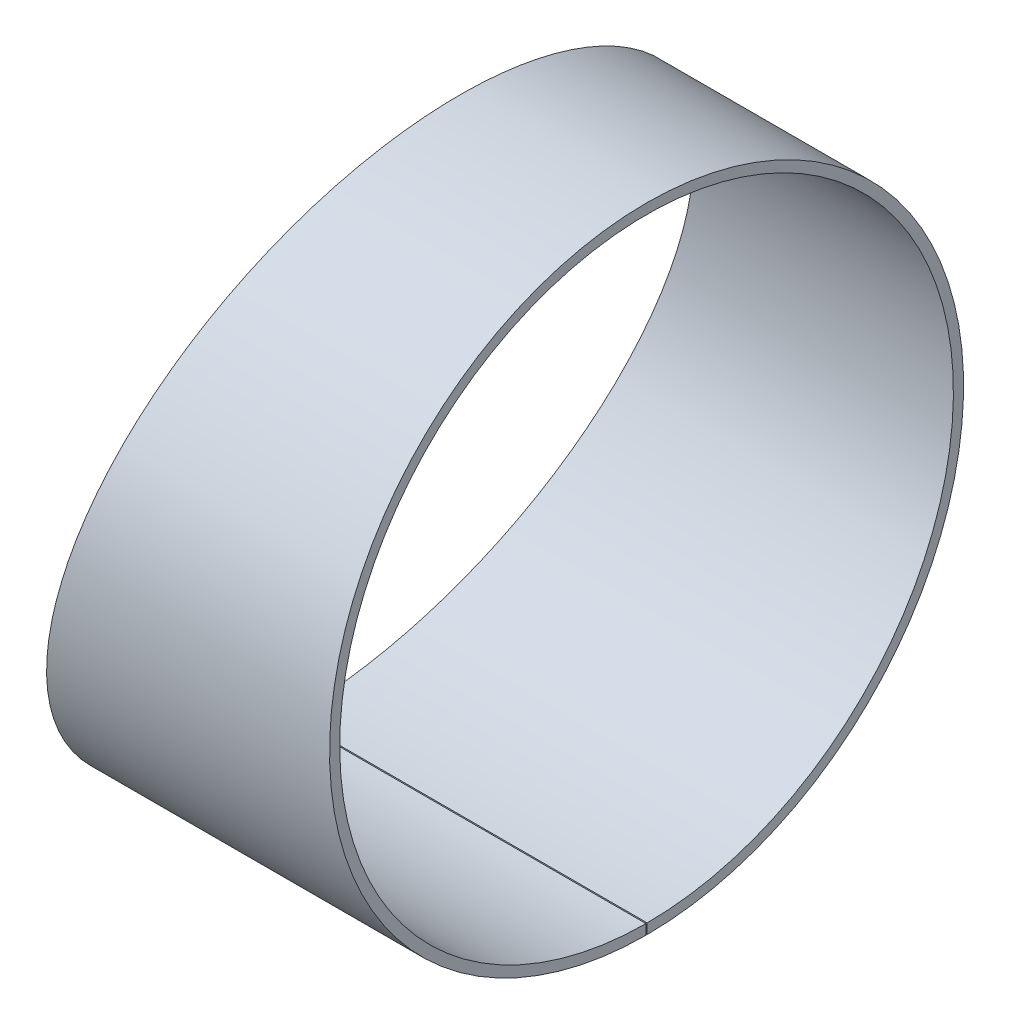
ISO-10303-21;
HEADER;
FILE_DESCRIPTION(('STEP AP214'),'2;1');
FILE_NAME('part.step','',(''),(''),'','','');
FILE_SCHEMA(('AUTOMOTIVE_DESIGN { 1 0 10303 214 1 1 1 1 }'));
ENDSEC;
DATA;
#1=APPLICATION_CONTEXT('core data for automotive mechanical design processes');
#2=APPLICATION_PROTOCOL_DEFINITION('international standard','automotive_design',2000,#1);
#3=PRODUCT_CONTEXT('',#1,'mechanical');
#4=PRODUCT('Part','Part','',(#3));
#5=PRODUCT_RELATED_PRODUCT_CATEGORY('part','',(#4));
#6=PRODUCT_DEFINITION_FORMATION('','',#4);
#7=PRODUCT_DEFINITION_CONTEXT('part definition',#1,'design');
#8=PRODUCT_DEFINITION('design','',#6,#7);
#9=PRODUCT_DEFINITION_SHAPE('','',#8);
#10=(LENGTH_UNIT() NAMED_UNIT(*) SI_UNIT(.MILLI.,.METRE.));
#11=(NAMED_UNIT(*) PLANE_ANGLE_UNIT() SI_UNIT($,.RADIAN.));
#12=(NAMED_UNIT(*) SI_UNIT($,.STERADIAN.) SOLID_ANGLE_UNIT());
#13=UNCERTAINTY_MEASURE_WITH_UNIT(LENGTH_MEASURE(1.E-05),#10,'distance_accuracy_value','');
#14=(GEOMETRIC_REPRESENTATION_CONTEXT(3) GLOBAL_UNCERTAINTY_ASSIGNED_CONTEXT((#13)) GLOBAL_UNIT_ASSIGNED_CONTEXT((#10,
#11,#12)) REPRESENTATION_CONTEXT('',''));
#15=CARTESIAN_POINT('',(0.,0.,0.));
#16=DIRECTION('',(0.,0.,1.));
#17=DIRECTION('',(1.,0.,0.));
#18=AXIS2_PLACEMENT_3D('',#15,#16,#17);
#19=CARTESIAN_POINT('',(518.65348192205,-1049.9994999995,0.499999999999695));
#20=CARTESIAN_POINT('',(518.654426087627,-1049.99806809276,1.21595193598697));
#21=CARTESIAN_POINT('',(518.655502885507,-1049.993784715,1.84337624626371));
#22=CARTESIAN_POINT('',(518.657317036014,-1049.98608163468,2.65171585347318));
#23=CARTESIAN_POINT('',(518.657954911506,-1049.98329212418,2.89902980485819));
#24=CARTESIAN_POINT('',(518.659296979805,-1049.97766354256,3.34939470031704));
#25=CARTESIAN_POINT('',(518.65999030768,-1049.97492462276,3.54587935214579));
#26=CARTESIAN_POINT('',(518.663754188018,-1049.96070760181,4.49709503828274));
#27=CARTESIAN_POINT('',(518.667921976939,-1049.94549812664,5.28240547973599));
#28=CARTESIAN_POINT('',(518.678570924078,-1049.90602971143,6.90160526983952));
#29=CARTESIAN_POINT('',(518.685042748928,-1049.88175978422,7.73199056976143));
#30=CARTESIAN_POINT('',(518.7001292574,-1049.82542678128,9.37729622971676));
#31=CARTESIAN_POINT('',(518.708764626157,-1049.79319165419,10.1999754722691));
#32=CARTESIAN_POINT('',(518.757402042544,-1049.61165623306,14.3133020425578));
#33=CARTESIAN_POINT('',(518.813774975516,-1049.40127113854,17.6032282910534));
#34=CARTESIAN_POINT('',(519.03518619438,-1048.57494136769,27.4585012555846));
#35=CARTESIAN_POINT('',(519.252580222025,-1047.763709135,34.0128358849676));
#36=CARTESIAN_POINT('',(519.827174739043,-1045.61916106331,47.0633221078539));
#37=CARTESIAN_POINT('',(520.184125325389,-1044.28721707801,53.5537092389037));
#38=CARTESIAN_POINT('',(521.040039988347,-1041.09385602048,66.4680132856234));
#39=CARTESIAN_POINT('',(521.538770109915,-1039.23279708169,72.8878482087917));
#40=CARTESIAN_POINT('',(523.247278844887,-1032.85561416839,91.9681543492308));
#41=CARTESIAN_POINT('',(524.667075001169,-1027.55758006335,104.431735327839));
#42=CARTESIAN_POINT('',(527.239934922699,-1017.95597532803,122.647065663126));
#43=CARTESIAN_POINT('',(528.170771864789,-1014.48137848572,128.632265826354));
#44=CARTESIAN_POINT('',(530.178879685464,-1006.98602361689,140.375594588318));
#45=CARTESIAN_POINT('',(531.255774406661,-1002.96768950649,146.132420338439));
#46=CARTESIAN_POINT('',(533.56975331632,-994.332984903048,157.43334537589));
#47=CARTESIAN_POINT('',(534.805135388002,-989.7223422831,162.967666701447));
#48=CARTESIAN_POINT('',(536.775797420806,-982.366745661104,171.04276355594));
#49=CARTESIAN_POINT('',(537.452282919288,-979.841667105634,173.696703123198));
#50=CARTESIAN_POINT('',(538.844450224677,-974.645880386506,178.920055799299));
#51=CARTESIAN_POINT('',(539.560326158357,-971.97464827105,181.490398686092));
#52=CARTESIAN_POINT('',(541.778287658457,-963.69874531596,189.100234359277));
#53=CARTESIAN_POINT('',(543.346887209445,-957.845364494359,194.024429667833));
#54=CARTESIAN_POINT('',(545.834724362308,-948.559371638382,201.110100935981));
#55=CARTESIAN_POINT('',(546.686493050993,-945.379821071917,203.421829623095));
#56=CARTESIAN_POINT('',(548.435009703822,-938.85328542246,207.931474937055));
#57=CARTESIAN_POINT('',(549.329666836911,-935.514301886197,210.124828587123));
#58=CARTESIAN_POINT('',(552.10857510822,-925.145316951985,216.575455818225));
#59=CARTESIAN_POINT('',(554.081243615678,-917.784976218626,220.686104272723));
#60=CARTESIAN_POINT('',(557.220340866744,-906.067967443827,226.425485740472));
#61=CARTESIAN_POINT('',(558.296722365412,-902.049766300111,228.267365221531));
#62=CARTESIAN_POINT('',(559.956318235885,-895.855231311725,230.904332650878));
#63=CARTESIAN_POINT('',(560.515829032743,-893.767074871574,231.760603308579));
#64=CARTESIAN_POINT('',(561.657382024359,-889.506872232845,233.438988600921));
#65=CARTESIAN_POINT('',(562.239256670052,-887.335390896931,234.260685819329));
#66=CARTESIAN_POINT('',(564.018175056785,-880.696491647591,236.664813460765));
#67=CARTESIAN_POINT('',(565.24851324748,-876.104476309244,238.186372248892));
#68=CARTESIAN_POINT('',(567.797974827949,-866.589759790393,241.019590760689));
#69=CARTESIAN_POINT('',(569.141499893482,-861.576171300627,242.358737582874));
#70=CARTESIAN_POINT('',(571.26412531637,-853.654141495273,244.189636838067));
#71=CARTESIAN_POINT('',(571.989328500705,-850.94743893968,244.769976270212));
#72=CARTESIAN_POINT('',(573.103625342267,-846.788788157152,245.586654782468));
#73=CARTESIAN_POINT('',(573.482472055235,-845.375004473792,245.852176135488));
#74=CARTESIAN_POINT('',(574.26210958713,-842.465606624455,246.371377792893));
#75=CARTESIAN_POINT('',(574.661798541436,-840.974088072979,246.624248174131));
#76=CARTESIAN_POINT('',(575.890475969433,-836.388855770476,247.356895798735));
#77=CARTESIAN_POINT('',(576.749075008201,-833.184396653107,247.810802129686));
#78=CARTESIAN_POINT('',(578.096194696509,-828.156479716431,248.415100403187));
#79=CARTESIAN_POINT('',(578.555104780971,-826.443652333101,248.603749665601));
#80=CARTESIAN_POINT('',(579.141080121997,-824.256710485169,248.820829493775));
#81=CARTESIAN_POINT('',(579.257388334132,-823.822624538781,248.862792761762));
#82=CARTESIAN_POINT('',(579.500195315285,-822.916530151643,248.94786543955));
#83=CARTESIAN_POINT('',(579.626727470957,-822.444393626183,248.99094841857));
#84=CARTESIAN_POINT('',(580.021709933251,-820.970650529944,249.120863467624));
#85=CARTESIAN_POINT('',(580.305546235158,-819.911707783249,249.208388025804));
#86=CARTESIAN_POINT('',(581.827301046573,-814.234000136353,249.636018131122));
#87=CARTESIAN_POINT('',(583.372939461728,-808.464053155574,249.954555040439));
#88=CARTESIAN_POINT('',(585.481046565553,-800.595637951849,250.000819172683));
#89=CARTESIAN_POINT('',(585.723778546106,-799.689769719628,250.001375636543));
#90=CARTESIAN_POINT('',(586.198266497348,-797.918843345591,249.99290559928));
#91=CARTESIAN_POINT('',(586.430481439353,-797.052081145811,249.984057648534));
#92=CARTESIAN_POINT('',(587.112039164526,-794.508020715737,249.94542480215));
#93=CARTESIAN_POINT('',(587.546294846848,-792.886958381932,249.903575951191));
#94=CARTESIAN_POINT('',(588.788713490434,-788.249299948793,249.742850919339));
#95=CARTESIAN_POINT('',(589.536528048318,-785.458329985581,249.589201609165));
#96=CARTESIAN_POINT('',(590.871228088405,-780.478043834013,249.249118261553));
#97=CARTESIAN_POINT('',(591.458113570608,-778.288663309,249.062685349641));
#98=CARTESIAN_POINT('',(592.091139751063,-775.926440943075,248.838680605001));
#99=CARTESIAN_POINT('',(592.211635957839,-775.476733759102,248.794725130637));
#100=CARTESIAN_POINT('',(592.453550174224,-774.57388113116,248.704077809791));
#101=CARTESIAN_POINT('',(592.573858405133,-774.124868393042,248.657755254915));
#102=CARTESIAN_POINT('',(592.932836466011,-772.785079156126,248.515904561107));
#103=CARTESIAN_POINT('',(593.169559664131,-771.901551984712,248.417493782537));
#104=CARTESIAN_POINT('',(594.340198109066,-767.532332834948,247.907713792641));
#105=CARTESIAN_POINT('',(595.235180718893,-764.19198921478,247.443293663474));
#106=CARTESIAN_POINT('',(596.942089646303,-757.821972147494,246.437438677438));
#107=CARTESIAN_POINT('',(597.754015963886,-754.792278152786,245.896006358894));
#108=CARTESIAN_POINT('',(599.294812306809,-749.041966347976,244.76899898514));
#109=CARTESIAN_POINT('',(600.045929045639,-746.238537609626,244.167121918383));
#110=CARTESIAN_POINT('',(602.243738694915,-738.035890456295,242.264240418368));
#111=CARTESIAN_POINT('',(603.63207371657,-732.855088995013,240.869064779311));
#112=CARTESIAN_POINT('',(606.265973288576,-723.025213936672,237.91012536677));
#113=CARTESIAN_POINT('',(607.53553554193,-718.286818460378,236.318793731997));
#114=CARTESIAN_POINT('',(609.36879762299,-711.445142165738,233.80321048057));
#115=CARTESIAN_POINT('',(609.968038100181,-709.208862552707,232.94322544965));
#116=CARTESIAN_POINT('',(611.142825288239,-704.824598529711,231.18654778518));
#117=CARTESIAN_POINT('',(611.719491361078,-702.672310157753,230.288283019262));
#118=CARTESIAN_POINT('',(614.56809003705,-692.039504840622,225.677849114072));
#119=CARTESIAN_POINT('',(616.718331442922,-684.012809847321,221.635415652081));
#120=CARTESIAN_POINT('',(619.750737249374,-672.697580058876,215.204357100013));
#121=CARTESIAN_POINT('',(620.729379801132,-669.046348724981,212.999283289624));
#122=CARTESIAN_POINT('',(622.622346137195,-661.982690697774,208.491668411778));
#123=CARTESIAN_POINT('',(623.53789475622,-658.565312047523,206.186763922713));
#124=CARTESIAN_POINT('',(626.21976094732,-648.554680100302,199.076179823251));
#125=CARTESIAN_POINT('',(627.911078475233,-642.241673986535,194.098706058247));
#126=CARTESIAN_POINT('',(630.303164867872,-633.315466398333,186.364603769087));
#127=CARTESIAN_POINT('',(631.076378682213,-630.430487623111,183.741860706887));
#128=CARTESIAN_POINT('',(632.574509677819,-624.840328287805,178.420795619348));
#129=CARTESIAN_POINT('',(633.299355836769,-622.135174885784,175.722961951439));
#130=CARTESIAN_POINT('',(635.413786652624,-614.243182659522,167.48798849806));
#131=CARTESIAN_POINT('',(636.73915503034,-609.295940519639,161.824093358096));
#132=CARTESIAN_POINT('',(639.221387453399,-600.032659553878,150.226955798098));
#133=CARTESIAN_POINT('',(640.377103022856,-595.720793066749,144.300173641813));
#134=CARTESIAN_POINT('',(642.525176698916,-587.703765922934,132.222704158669));
#135=CARTESIAN_POINT('',(643.520469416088,-583.988268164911,126.055138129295));
#136=CARTESIAN_POINT('',(645.353566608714,-577.146825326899,113.522811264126));
#137=CARTESIAN_POINT('',(646.191371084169,-574.020863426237,107.158067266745));
#138=CARTESIAN_POINT('',(647.709491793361,-568.356117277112,94.2896237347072));
#139=CARTESIAN_POINT('',(648.390745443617,-565.812979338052,87.7776575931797));
#140=CARTESIAN_POINT('',(649.602323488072,-561.290492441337,74.6072973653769));
#141=CARTESIAN_POINT('',(650.131955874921,-559.313951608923,67.955129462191));
#142=CARTESIAN_POINT('',(651.038907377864,-555.930087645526,54.566944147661));
#143=CARTESIAN_POINT('',(651.415919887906,-554.523480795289,47.8370709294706));
#144=CARTESIAN_POINT('',(652.321918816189,-551.141160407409,27.5264472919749));
#145=CARTESIAN_POINT('',(652.625254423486,-550.010007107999,13.8363370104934));
#146=CARTESIAN_POINT('',(652.630598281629,-549.990125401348,-13.4723187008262));
#147=CARTESIAN_POINT('',(652.332608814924,-551.101239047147,-27.1627266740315));
#148=CARTESIAN_POINT('',(651.434632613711,-554.453631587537,-47.4771807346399));
#149=CARTESIAN_POINT('',(651.060321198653,-555.850192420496,-54.2082216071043));
#150=CARTESIAN_POINT('',(650.158773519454,-559.213843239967,-67.5994566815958));
#151=CARTESIAN_POINT('',(649.631835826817,-561.180281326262,-74.2536767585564));
#152=CARTESIAN_POINT('',(648.425632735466,-565.682691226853,-87.4292019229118));
#153=CARTESIAN_POINT('',(647.747028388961,-568.21602764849,-93.9446169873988));
#154=CARTESIAN_POINT('',(646.234404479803,-573.860353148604,-106.818823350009));
#155=CARTESIAN_POINT('',(645.3992922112,-576.976209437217,-113.187199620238));
#156=CARTESIAN_POINT('',(643.571467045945,-583.797875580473,-125.72825740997));
#157=CARTESIAN_POINT('',(642.578754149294,-587.503702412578,-131.900922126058));
#158=CARTESIAN_POINT('',(640.435727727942,-595.502045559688,-143.989987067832));
#159=CARTESIAN_POINT('',(639.28278450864,-599.803634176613,-149.921546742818));
#160=CARTESIAN_POINT('',(636.805764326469,-609.047425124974,-161.530706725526));
#161=CARTESIAN_POINT('',(635.482947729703,-613.985087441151,-167.201242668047));
#162=CARTESIAN_POINT('',(633.372263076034,-621.863086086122,-175.447116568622));
#163=CARTESIAN_POINT('',(632.648644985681,-624.563677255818,-178.148743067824));
#164=CARTESIAN_POINT('',(631.153387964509,-630.143116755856,-183.476203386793));
#165=CARTESIAN_POINT('',(630.381609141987,-633.02272654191,-186.102326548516));
#166=CARTESIAN_POINT('',(627.993821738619,-641.932834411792,-193.847141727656));
#167=CARTESIAN_POINT('',(626.305362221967,-648.235115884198,-198.832521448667));
#168=CARTESIAN_POINT('',(623.62777107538,-658.229831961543,-205.956202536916));
#169=CARTESIAN_POINT('',(622.713514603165,-661.642444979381,-208.265949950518));
#170=CARTESIAN_POINT('',(620.824429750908,-668.691715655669,-212.78076370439));
#171=CARTESIAN_POINT('',(619.847711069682,-672.335761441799,-214.989833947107));
#172=CARTESIAN_POINT('',(616.821026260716,-683.629557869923,-221.434112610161));
#173=CARTESIAN_POINT('',(614.674531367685,-691.642125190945,-225.487003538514));
#174=CARTESIAN_POINT('',(611.261731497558,-704.380995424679,-231.037790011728));
#175=CARTESIAN_POINT('',(610.094422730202,-708.737148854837,-232.797410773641));
#176=CARTESIAN_POINT('',(607.655568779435,-717.838845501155,-236.163263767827));
#177=CARTESIAN_POINT('',(606.388704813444,-722.56713727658,-237.761272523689));
#178=CARTESIAN_POINT('',(604.417253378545,-729.924765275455,-239.991727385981));
#179=CARTESIAN_POINT('',(603.744608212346,-732.434934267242,-240.711721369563));
#180=CARTESIAN_POINT('',(602.358807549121,-737.606575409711,-242.103761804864));
#181=CARTESIAN_POINT('',(601.647118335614,-740.26260447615,-242.774141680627));
#182=CARTESIAN_POINT('',(600.186162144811,-745.71515026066,-244.051214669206));
#183=CARTESIAN_POINT('',(599.436895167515,-748.511670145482,-244.657906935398));
#184=CARTESIAN_POINT('',(597.900783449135,-754.244566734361,-245.794588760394));
#185=CARTESIAN_POINT('',(597.096123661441,-757.247166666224,-246.338146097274));
#186=CARTESIAN_POINT('',(595.398919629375,-763.580904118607,-247.353868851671));
#187=CARTESIAN_POINT('',(594.508747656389,-766.903242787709,-247.824273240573));
#188=CARTESIAN_POINT('',(593.111134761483,-772.119615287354,-248.446675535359));
#189=CARTESIAN_POINT('',(592.634988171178,-773.896763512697,-248.640207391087));
#190=CARTESIAN_POINT('',(591.661442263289,-777.530078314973,-248.994847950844));
#191=CARTESIAN_POINT('',(591.09423028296,-779.646056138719,-249.181834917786));
#192=CARTESIAN_POINT('',(589.798928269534,-784.479136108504,-249.529502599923));
#193=CARTESIAN_POINT('',(589.070838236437,-787.196300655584,-249.69018274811));
#194=CARTESIAN_POINT('',(587.858044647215,-791.723245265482,-249.867516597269));
#195=CARTESIAN_POINT('',(587.433670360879,-793.307404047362,-249.915912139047));
#196=CARTESIAN_POINT('',(586.766944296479,-795.796167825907,-249.966030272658));
#197=CARTESIAN_POINT('',(586.539674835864,-796.644507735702,-249.978984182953));
#198=CARTESIAN_POINT('',(586.075081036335,-798.378620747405,-249.996245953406));
#199=CARTESIAN_POINT('',(585.835379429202,-799.273225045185,-250.000538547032));
#200=CARTESIAN_POINT('',(583.68190011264,-807.31035751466,-249.99519418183));
#201=CARTESIAN_POINT('',(582.095773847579,-813.232168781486,-249.693926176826));
#202=CARTESIAN_POINT('',(580.523212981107,-819.099609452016,-249.272118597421));
#203=CARTESIAN_POINT('',(580.229205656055,-820.196504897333,-249.18497155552));
#204=CARTESIAN_POINT('',(579.818951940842,-821.727170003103,-249.054597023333));
#205=CARTESIAN_POINT('',(579.687326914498,-822.218279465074,-249.011189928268));
#206=CARTESIAN_POINT('',(579.434329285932,-823.162316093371,-248.925152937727));
#207=CARTESIAN_POINT('',(579.31414653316,-823.610816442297,-248.882953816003));
#208=CARTESIAN_POINT('',(578.724744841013,-825.810505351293,-248.670350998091));
#209=CARTESIAN_POINT('',(578.263102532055,-827.533519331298,-248.484984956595));
#210=CARTESIAN_POINT('',(576.907812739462,-832.59193195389,-247.889684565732));
#211=CARTESIAN_POINT('',(576.043802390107,-835.816634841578,-247.440641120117));
#212=CARTESIAN_POINT('',(574.394814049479,-841.970457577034,-246.471464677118));
#213=CARTESIAN_POINT('',(573.609958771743,-844.899138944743,-245.951422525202));
#214=CARTESIAN_POINT('',(572.118788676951,-850.464257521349,-244.870156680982));
#215=CARTESIAN_POINT('',(571.390883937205,-853.181044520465,-244.293208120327));
#216=CARTESIAN_POINT('',(569.260210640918,-861.133140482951,-242.471275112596));
#217=CARTESIAN_POINT('',(567.910483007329,-866.169916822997,-241.135484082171));
#218=CARTESIAN_POINT('',(565.352470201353,-875.716466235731,-238.310294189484));
#219=CARTESIAN_POINT('',(564.118993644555,-880.320224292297,-236.793011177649));
#220=CARTESIAN_POINT('',(562.334641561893,-886.979423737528,-234.393146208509));
#221=CARTESIAN_POINT('',(561.750969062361,-889.157619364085,-233.572659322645));
#222=CARTESIAN_POINT('',(560.60584711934,-893.431130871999,-231.896295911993));
#223=CARTESIAN_POINT('',(560.044888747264,-895.524655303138,-231.041328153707));
#224=CARTESIAN_POINT('',(558.381170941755,-901.734520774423,-228.408203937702));
#225=CARTESIAN_POINT('',(557.302101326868,-905.762763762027,-226.568362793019));
#226=CARTESIAN_POINT('',(554.155119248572,-917.50926699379,-220.83367732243));
#227=CARTESIAN_POINT('',(552.177433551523,-924.888423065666,-216.724268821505));
#228=CARTESIAN_POINT('',(549.391358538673,-935.28409803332,-210.273261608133));
#229=CARTESIAN_POINT('',(548.494562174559,-938.631011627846,-208.079846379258));
#230=CARTESIAN_POINT('',(546.742178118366,-945.171946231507,-203.570346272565));
#231=CARTESIAN_POINT('',(545.8885323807,-948.358499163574,-201.258439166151));
#232=CARTESIAN_POINT('',(543.395234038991,-957.664883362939,-194.171571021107));
#233=CARTESIAN_POINT('',(541.823220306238,-963.5310348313,-189.245696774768));
#234=CARTESIAN_POINT('',(539.600477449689,-971.824810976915,-181.632369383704));
#235=CARTESIAN_POINT('',(538.883052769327,-974.50183318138,-179.060638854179));
#236=CARTESIAN_POINT('',(537.488129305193,-979.707910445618,-173.835177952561));
#237=CARTESIAN_POINT('',(536.810318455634,-982.237929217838,-171.180091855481));
#238=CARTESIAN_POINT('',(534.835838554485,-989.607743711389,-163.101349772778));
#239=CARTESIAN_POINT('',(533.598122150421,-994.227059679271,-157.564325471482));
#240=CARTESIAN_POINT('',(531.279896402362,-1002.8776069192,-146.257799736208));
#241=CARTESIAN_POINT('',(530.201128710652,-1006.90301007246,-140.49820136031));
#242=CARTESIAN_POINT('',(528.189623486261,-1014.41112779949,-128.749634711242));
#243=CARTESIAN_POINT('',(527.257202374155,-1017.89164006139,-122.761613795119));
#244=CARTESIAN_POINT('',(524.679933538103,-1027.50964972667,-104.537466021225));
#245=CARTESIAN_POINT('',(523.257711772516,-1032.81665393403,-92.0680157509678));
#246=CARTESIAN_POINT('',(521.546078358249,-1039.20551439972,-72.9777387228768));
#247=CARTESIAN_POINT('',(521.04639182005,-1041.07015493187,-66.554361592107));
#248=CARTESIAN_POINT('',(520.1887346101,-1044.27002430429,-53.632619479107));
#249=CARTESIAN_POINT('',(519.831002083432,-1045.60487382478,-47.13845879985));
#250=CARTESIAN_POINT('',(519.255013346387,-1047.7546450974,-34.0796739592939));
#251=CARTESIAN_POINT('',(519.037004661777,-1048.56813740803,-27.5214675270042));
#252=CARTESIAN_POINT('',(518.81479229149,-1049.39748182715,-17.6573946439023));
#253=CARTESIAN_POINT('',(518.75814750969,-1049.60891117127,-14.3612055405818));
#254=CARTESIAN_POINT('',(518.709268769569,-1049.79125498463,-10.2473035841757));
#255=CARTESIAN_POINT('',(518.700591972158,-1049.82362532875,-9.42507837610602));
#256=CARTESIAN_POINT('',(518.689225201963,-1049.86606353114,-8.19263475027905));
#257=CARTESIAN_POINT('',(518.685711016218,-1049.87919005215,-7.78196923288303));
#258=CARTESIAN_POINT('',(518.679232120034,-1049.90340912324,-6.96094640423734));
#259=CARTESIAN_POINT('',(518.676271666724,-1049.91444060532,-6.55366909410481));
#260=CARTESIAN_POINT('',(518.662740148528,-1049.96620888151,-4.4436070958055));
#261=CARTESIAN_POINT('',(518.656045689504,-1049.9953673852,-2.56630301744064));
#262=CARTESIAN_POINT('',(518.65348192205,-1049.9994999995,-0.49999999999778));
#263=CARTESIAN_POINT('',(518.65348192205,-1041.99951599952,0.483999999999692));
#264=CARTESIAN_POINT('',(518.654426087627,-1041.9981299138,1.17704147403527));
#265=CARTESIAN_POINT('',(518.655502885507,-1041.99398360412,1.78438820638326));
#266=CARTESIAN_POINT('',(518.657317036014,-1041.98652702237,2.56686094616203));
#267=CARTESIAN_POINT('',(518.657954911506,-1041.98382677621,2.80626085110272));
#268=CARTESIAN_POINT('',(518.659296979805,-1041.9783783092,3.24221406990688));
#269=CARTESIAN_POINT('',(518.65999030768,-1041.97572703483,3.43241121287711));
#270=CARTESIAN_POINT('',(518.663754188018,-1041.96196495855,4.35318799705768));
#271=CARTESIAN_POINT('',(518.667921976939,-1041.94724218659,5.11336850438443));
#272=CARTESIAN_POINT('',(518.678570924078,-1041.90903676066,6.68075390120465));
#273=CARTESIAN_POINT('',(518.685042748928,-1041.88554347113,7.48456687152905));
#274=CARTESIAN_POINT('',(518.7001292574,-1041.83101312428,9.07722275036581));
#275=CARTESIAN_POINT('',(518.708764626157,-1041.79980952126,9.87357625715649));
#276=CARTESIAN_POINT('',(518.757402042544,-1041.6240832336,13.855276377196));
#277=CARTESIAN_POINT('',(518.813774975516,-1041.42043046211,17.0399249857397));
#278=CARTESIAN_POINT('',(519.03518619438,-1040.62054324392,26.5798292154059));
#279=CARTESIAN_POINT('',(519.252580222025,-1039.83527044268,32.9244251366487));
#280=CARTESIAN_POINT('',(519.827174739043,-1037.75934790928,45.5572958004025));
#281=CARTESIAN_POINT('',(520.184125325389,-1036.47002613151,51.8399905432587));
#282=CARTESIAN_POINT('',(521.040039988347,-1033.37885262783,64.3410368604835));
#283=CARTESIAN_POINT('',(521.538770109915,-1031.57734757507,70.5554370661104));
#284=CARTESIAN_POINT('',(523.247278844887,-1025.404234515,89.0251734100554));
#285=CARTESIAN_POINT('',(524.667075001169,-1020.27573750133,101.089919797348));
#286=CARTESIAN_POINT('',(527.239934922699,-1010.98138411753,118.722359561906));
#287=CARTESIAN_POINT('',(528.170771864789,-1007.61797437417,124.516033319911));
#288=CARTESIAN_POINT('',(530.178879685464,-1000.36247086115,135.883575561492));
#289=CARTESIAN_POINT('',(531.255774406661,-996.47272344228,141.456182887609));
#290=CARTESIAN_POINT('',(533.56975331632,-988.11432938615,152.395478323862));
#291=CARTESIAN_POINT('',(534.805135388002,-983.651227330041,157.752701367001));
#292=CARTESIAN_POINT('',(536.775797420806,-976.531009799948,165.56939512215));
#293=CARTESIAN_POINT('',(537.452282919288,-974.086733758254,168.138408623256));
#294=CARTESIAN_POINT('',(538.844450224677,-969.057212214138,173.194614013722));
#295=CARTESIAN_POINT('',(539.560326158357,-966.471459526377,175.682705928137));
#296=CARTESIAN_POINT('',(541.778287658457,-958.460385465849,183.049026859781));
#297=CARTESIAN_POINT('',(543.346887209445,-952.794312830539,187.815647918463));
#298=CARTESIAN_POINT('',(545.834724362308,-943.805471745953,194.674577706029));
#299=CARTESIAN_POINT('',(546.686493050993,-940.727666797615,196.912331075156));
#300=CARTESIAN_POINT('',(548.435009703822,-934.409980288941,201.277667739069));
#301=CARTESIAN_POINT('',(549.329666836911,-931.177844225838,203.400834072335));
#302=CARTESIAN_POINT('',(552.10857510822,-921.140666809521,209.645041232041));
#303=CARTESIAN_POINT('',(554.081243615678,-914.01585697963,213.624148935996));
#304=CARTESIAN_POINT('',(557.220340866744,-902.673792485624,219.179870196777));
#305=CARTESIAN_POINT('',(558.296722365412,-898.784173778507,220.962809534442));
#306=CARTESIAN_POINT('',(559.956318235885,-892.787863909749,223.51539400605));
#307=CARTESIAN_POINT('',(560.515829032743,-890.766528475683,224.344264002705));
#308=CARTESIAN_POINT('',(561.657382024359,-886.642652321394,225.968940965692));
#309=CARTESIAN_POINT('',(562.239256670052,-884.540658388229,226.76434387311));
#310=CARTESIAN_POINT('',(564.018175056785,-878.114203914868,229.09153943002));
#311=CARTESIAN_POINT('',(565.24851324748,-873.669133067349,230.564408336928));
#312=CARTESIAN_POINT('',(567.797974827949,-864.458887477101,233.306963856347));
#313=CARTESIAN_POINT('',(569.141499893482,-859.605733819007,234.603257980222));
#314=CARTESIAN_POINT('',(571.26412531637,-851.937208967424,236.375568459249));
#315=CARTESIAN_POINT('',(571.989328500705,-849.317120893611,236.937337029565));
#316=CARTESIAN_POINT('',(573.103625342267,-845.291546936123,237.727881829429));
#317=CARTESIAN_POINT('',(573.482472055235,-843.92300433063,237.984906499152));
#318=CARTESIAN_POINT('',(574.26210958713,-841.106707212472,238.487493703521));
#319=CARTESIAN_POINT('',(574.661798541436,-839.662917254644,238.732272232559));
#320=CARTESIAN_POINT('',(575.890475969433,-835.224412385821,239.441475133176));
#321=CARTESIAN_POINT('',(576.749075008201,-832.122495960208,239.880856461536));
#322=CARTESIAN_POINT('',(578.096194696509,-827.255472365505,240.465817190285));
#323=CARTESIAN_POINT('',(578.555104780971,-825.597455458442,240.648429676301));
#324=CARTESIAN_POINT('',(579.141080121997,-823.480495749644,240.858562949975));
#325=CARTESIAN_POINT('',(579.257388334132,-823.060300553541,240.899183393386));
#326=CARTESIAN_POINT('',(579.500195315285,-822.18320118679,240.981533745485));
#327=CARTESIAN_POINT('',(579.626727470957,-821.726173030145,241.023238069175));
#328=CARTESIAN_POINT('',(580.021709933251,-820.299589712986,241.14899583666));
#329=CARTESIAN_POINT('',(580.305546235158,-819.274533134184,241.233719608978));
#330=CARTESIAN_POINT('',(581.827301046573,-813.77851213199,241.647665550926));
#331=CARTESIAN_POINT('',(583.372939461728,-808.193203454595,241.956009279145));
#332=CARTESIAN_POINT('',(585.481046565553,-800.57657753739,242.000792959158));
#333=CARTESIAN_POINT('',(585.723778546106,-799.6996970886,242.001331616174));
#334=CARTESIAN_POINT('',(586.198266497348,-797.985440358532,241.993132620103));
#335=CARTESIAN_POINT('',(586.430481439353,-797.146414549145,241.984567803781));
#336=CARTESIAN_POINT('',(587.112039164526,-794.683764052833,241.947171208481));
#337=CARTESIAN_POINT('',(587.546294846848,-793.114575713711,241.906661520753));
#338=CARTESIAN_POINT('',(588.788713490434,-788.625322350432,241.75107968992));
#339=CARTESIAN_POINT('',(589.536528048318,-785.923663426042,241.602347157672));
#340=CARTESIAN_POINT('',(590.871228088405,-781.102746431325,241.273146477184));
#341=CARTESIAN_POINT('',(591.458113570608,-778.983426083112,241.092679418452));
#342=CARTESIAN_POINT('',(592.091139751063,-776.696794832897,240.875842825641));
#343=CARTESIAN_POINT('',(592.211635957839,-776.26147827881,240.833293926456));
#344=CARTESIAN_POINT('',(592.453550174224,-775.387516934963,240.745547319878));
#345=CARTESIAN_POINT('',(592.573858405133,-774.952872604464,240.700707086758));
#346=CARTESIAN_POINT('',(592.932836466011,-773.65595662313,240.563395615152));
#347=CARTESIAN_POINT('',(593.169559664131,-772.800702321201,240.468133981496));
#348=CARTESIAN_POINT('',(594.340198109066,-768.571298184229,239.974666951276));
#349=CARTESIAN_POINT('',(595.235180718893,-765.337845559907,239.525108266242));
#350=CARTESIAN_POINT('',(596.942089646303,-759.171669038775,238.551440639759));
#351=CARTESIAN_POINT('',(597.754015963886,-756.238925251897,238.027334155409));
#352=CARTESIAN_POINT('',(599.294812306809,-750.67262342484,236.936391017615));
#353=CARTESIAN_POINT('',(600.045929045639,-747.958904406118,236.353774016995));
#354=CARTESIAN_POINT('',(602.243738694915,-740.018741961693,234.511784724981));
#355=CARTESIAN_POINT('',(603.63207371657,-735.003726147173,233.161254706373));
#356=CARTESIAN_POINT('',(606.265973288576,-725.488407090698,230.297001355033));
#357=CARTESIAN_POINT('',(607.53553554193,-720.901640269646,228.756592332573));
#358=CARTESIAN_POINT('',(609.36879762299,-714.278897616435,226.321507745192));
#359=CARTESIAN_POINT('',(609.968038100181,-712.11417895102,225.489042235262));
#360=CARTESIAN_POINT('',(611.142825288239,-707.87021137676,223.788578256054));
#361=CARTESIAN_POINT('',(611.719491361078,-705.786796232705,222.919057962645));
#362=CARTESIAN_POINT('',(614.56809003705,-695.494240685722,218.456157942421));
#363=CARTESIAN_POINT('',(616.718331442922,-687.724399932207,214.543082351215));
#364=CARTESIAN_POINT('',(619.750737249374,-676.771257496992,208.317817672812));
#365=CARTESIAN_POINT('',(620.729379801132,-673.236865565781,206.183306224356));
#366=CARTESIAN_POINT('',(622.622346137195,-666.399244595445,201.819935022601));
#367=CARTESIAN_POINT('',(623.53789475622,-663.091222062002,199.588787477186));
#368=CARTESIAN_POINT('',(626.21976094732,-653.400930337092,192.705742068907));
#369=CARTESIAN_POINT('',(627.911078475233,-647.289940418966,187.887547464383));
#370=CARTESIAN_POINT('',(630.303164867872,-638.649371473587,180.400936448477));
#371=CARTESIAN_POINT('',(631.076378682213,-635.856712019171,177.862121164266));
#372=CARTESIAN_POINT('',(632.574509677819,-630.445437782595,172.711330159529));
#373=CARTESIAN_POINT('',(633.299355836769,-627.826849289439,170.099827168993));
#374=CARTESIAN_POINT('',(635.413786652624,-620.187400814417,162.128372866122));
#375=CARTESIAN_POINT('',(636.73915503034,-615.398470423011,156.645722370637));
#376=CARTESIAN_POINT('',(639.221387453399,-606.431614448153,145.419693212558));
#377=CARTESIAN_POINT('',(640.377103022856,-602.257727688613,139.682568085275));
#378=CARTESIAN_POINT('',(642.525176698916,-594.4972454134,127.991577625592));
#379=CARTESIAN_POINT('',(643.520469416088,-590.900643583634,122.021373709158));
#380=CARTESIAN_POINT('',(645.353566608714,-584.278126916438,109.890081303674));
#381=CARTESIAN_POINT('',(646.191371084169,-581.252195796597,103.729009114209));
#382=CARTESIAN_POINT('',(647.709491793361,-575.768721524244,91.2723557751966));
#383=CARTESIAN_POINT('',(648.390745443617,-573.306963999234,84.9687725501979));
#384=CARTESIAN_POINT('',(649.602323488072,-568.929196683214,72.2198638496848));
#385=CARTESIAN_POINT('',(650.131955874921,-567.015905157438,65.7805653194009));
#386=CARTESIAN_POINT('',(651.038907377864,-563.740324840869,52.8208019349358));
#387=CARTESIAN_POINT('',(651.415919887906,-562.378729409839,46.3062846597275));
#388=CARTESIAN_POINT('',(652.321918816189,-559.104643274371,26.6456009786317));
#389=CARTESIAN_POINT('',(652.625254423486,-558.009686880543,13.3935742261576));
#390=CARTESIAN_POINT('',(652.630598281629,-557.990441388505,-13.0412045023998));
#391=CARTESIAN_POINT('',(652.332608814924,-559.065999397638,-26.2935194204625));
#392=CARTESIAN_POINT('',(651.434632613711,-562.311115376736,-45.9579109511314));
#393=CARTESIAN_POINT('',(651.060321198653,-563.66298626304,-52.4735585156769));
#394=CARTESIAN_POINT('',(650.158773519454,-566.919000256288,-65.4362740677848));
#395=CARTESIAN_POINT('',(649.631835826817,-568.822512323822,-71.8775591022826));
#396=CARTESIAN_POINT('',(648.425632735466,-573.180845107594,-84.6314674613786));
#397=CARTESIAN_POINT('',(647.747028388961,-575.633114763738,-90.938389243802));
#398=CARTESIAN_POINT('',(646.234404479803,-581.096821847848,-103.400621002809));
#399=CARTESIAN_POINT('',(645.3992922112,-584.112970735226,-109.565209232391));
#400=CARTESIAN_POINT('',(643.571467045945,-590.716343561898,-121.704953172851));
#401=CARTESIAN_POINT('',(642.578754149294,-594.303583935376,-127.680092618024));
#402=CARTESIAN_POINT('',(640.435727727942,-602.045980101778,-139.382307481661));
#403=CARTESIAN_POINT('',(639.28278450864,-606.209917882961,-145.124057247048));
#404=CARTESIAN_POINT('',(636.805764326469,-615.157907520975,-156.36172411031));
#405=CARTESIAN_POINT('',(635.482947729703,-619.937564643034,-161.850802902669));
#406=CARTESIAN_POINT('',(633.372263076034,-627.563467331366,-169.832808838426));
#407=CARTESIAN_POINT('',(632.648644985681,-630.177639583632,-172.447983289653));
#408=CARTESIAN_POINT('',(631.153387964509,-635.578537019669,-177.604964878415));
#409=CARTESIAN_POINT('',(630.381609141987,-638.365999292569,-180.147052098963));
#410=CARTESIAN_POINT('',(627.993821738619,-646.990983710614,-187.644033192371));
#411=CARTESIAN_POINT('',(626.305362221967,-653.091592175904,-192.46988076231));
#412=CARTESIAN_POINT('',(623.62777107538,-662.766477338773,-199.365604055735));
#413=CARTESIAN_POINT('',(622.713514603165,-666.069886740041,-201.601439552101));
#414=CARTESIAN_POINT('',(620.824429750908,-672.893580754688,-205.97177926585));
#415=CARTESIAN_POINT('',(619.847711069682,-676.421017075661,-208.1101592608));
#416=CARTESIAN_POINT('',(616.821026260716,-687.353412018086,-214.348221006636));
#417=CARTESIAN_POINT('',(614.674531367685,-695.109577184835,-218.271419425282));
#418=CARTESIAN_POINT('',(611.261731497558,-707.440803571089,-223.644580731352));
#419=CARTESIAN_POINT('',(610.094422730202,-711.657560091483,-225.347893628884));
#420=CARTESIAN_POINT('',(607.655568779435,-720.468002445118,-228.606039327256));
#421=CARTESIAN_POINT('',(606.388704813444,-725.044988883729,-230.152911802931));
#422=CARTESIAN_POINT('',(604.417253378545,-732.16717278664,-232.31199210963));
#423=CARTESIAN_POINT('',(603.744608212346,-734.59701637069,-233.008946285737));
#424=CARTESIAN_POINT('',(602.358807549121,-739.6031649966,-234.356441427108));
#425=CARTESIAN_POINT('',(601.647118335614,-742.174201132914,-235.005369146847));
#426=CARTESIAN_POINT('',(600.186162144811,-747.452265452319,-236.241575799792));
#427=CARTESIAN_POINT('',(599.436895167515,-750.159296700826,-236.828853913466));
#428=CARTESIAN_POINT('',(597.900783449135,-755.708740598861,-237.929161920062));
#429=CARTESIAN_POINT('',(597.096123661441,-758.615257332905,-238.455325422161));
#430=CARTESIAN_POINT('',(595.398919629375,-764.746315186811,-239.438545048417));
#431=CARTESIAN_POINT('',(594.508747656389,-767.962339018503,-239.893896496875));
#432=CARTESIAN_POINT('',(593.111134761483,-773.011787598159,-240.496381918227));
#433=CARTESIAN_POINT('',(592.634988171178,-774.73206708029,-240.683720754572));
#434=CARTESIAN_POINT('',(591.661442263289,-778.249115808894,-241.027012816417));
#435=CARTESIAN_POINT('',(591.09423028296,-780.29738234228,-241.208016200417));
#436=CARTESIAN_POINT('',(589.798928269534,-784.975803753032,-241.544558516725));
#437=CARTESIAN_POINT('',(589.070838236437,-787.606019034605,-241.700096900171));
#438=CARTESIAN_POINT('',(587.858044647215,-791.988101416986,-241.871756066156));
#439=CARTESIAN_POINT('',(587.433670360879,-793.521567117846,-241.918602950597));
#440=CARTESIAN_POINT('',(586.766944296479,-795.930690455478,-241.967117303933));
#441=CARTESIAN_POINT('',(586.539674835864,-796.75188348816,-241.979656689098));
#442=CARTESIAN_POINT('',(586.075081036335,-798.430504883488,-241.996366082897));
#443=CARTESIAN_POINT('',(585.835379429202,-799.296481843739,-242.000521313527));
#444=CARTESIAN_POINT('',(583.68190011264,-807.076426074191,-241.995347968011));
#445=CARTESIAN_POINT('',(582.095773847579,-812.808739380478,-241.703720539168));
#446=CARTESIAN_POINT('',(580.523212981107,-818.488421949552,-241.295410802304));
#447=CARTESIAN_POINT('',(580.229205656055,-819.550216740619,-241.211052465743));
#448=CARTESIAN_POINT('',(579.818951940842,-821.031900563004,-241.084849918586));
#449=CARTESIAN_POINT('',(579.687326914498,-821.507294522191,-241.042831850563));
#450=CARTESIAN_POINT('',(579.434329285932,-822.421121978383,-240.95954804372));
#451=CARTESIAN_POINT('',(579.31414653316,-822.855270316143,-240.918699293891));
#452=CARTESIAN_POINT('',(578.724744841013,-824.984569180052,-240.712899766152));
#453=CARTESIAN_POINT('',(578.263102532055,-826.652446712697,-240.533465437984));
#454=CARTESIAN_POINT('',(576.907812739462,-831.548990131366,-239.957214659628));
#455=CARTESIAN_POINT('',(576.043802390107,-834.670502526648,-239.522540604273));
#456=CARTESIAN_POINT('',(574.394814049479,-840.627402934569,-238.58437780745));
#457=CARTESIAN_POINT('',(573.609958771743,-843.462366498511,-238.080977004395));
#458=CARTESIAN_POINT('',(572.118788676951,-848.849401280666,-237.03431166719));
#459=CARTESIAN_POINT('',(571.390883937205,-851.47925109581,-236.475825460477));
#460=CARTESIAN_POINT('',(569.260210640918,-859.176879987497,-234.712194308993));
#461=CARTESIAN_POINT('',(567.910483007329,-864.052479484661,-233.419148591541));
#462=CARTESIAN_POINT('',(565.352470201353,-873.293539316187,-230.684364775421));
#463=CARTESIAN_POINT('',(564.118993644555,-877.749977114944,-229.215634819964));
#464=CARTESIAN_POINT('',(562.334641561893,-884.196082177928,-226.892565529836));
#465=CARTESIAN_POINT('',(561.750969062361,-886.304575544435,-226.09833422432));
#466=CARTESIAN_POINT('',(560.60584711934,-890.441334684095,-224.47561444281));
#467=CARTESIAN_POINT('',(560.044888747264,-892.467866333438,-223.648005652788));
#468=CARTESIAN_POINT('',(558.381170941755,-898.479016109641,-221.099141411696));
#469=CARTESIAN_POINT('',(557.302101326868,-902.378355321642,-219.318175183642));
#470=CARTESIAN_POINT('',(554.155119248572,-913.748970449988,-213.766999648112));
#471=CARTESIAN_POINT('',(552.177433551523,-920.891993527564,-209.789092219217));
#472=CARTESIAN_POINT('',(549.391358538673,-930.955006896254,-203.544517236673));
#473=CARTESIAN_POINT('',(548.494562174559,-934.194819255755,-201.421291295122));
#474=CARTESIAN_POINT('',(546.742178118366,-940.526443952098,-197.056095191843));
#475=CARTESIAN_POINT('',(545.8885323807,-943.61102719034,-194.818169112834));
#476=CARTESIAN_POINT('',(543.395234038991,-952.619607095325,-187.958080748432));
#477=CARTESIAN_POINT('',(541.823220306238,-958.298041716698,-183.189834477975));
#478=CARTESIAN_POINT('',(539.600477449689,-966.326417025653,-175.820133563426));
#479=CARTESIAN_POINT('',(538.883052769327,-968.917774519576,-173.330698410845));
#480=CARTESIAN_POINT('',(537.488129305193,-973.957257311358,-168.272452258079));
#481=CARTESIAN_POINT('',(536.810318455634,-976.406315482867,-165.702328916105));
#482=CARTESIAN_POINT('',(534.835838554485,-983.540295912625,-157.882106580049));
#483=CARTESIAN_POINT('',(533.598122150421,-988.011793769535,-152.522267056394));
#484=CARTESIAN_POINT('',(531.279896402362,-996.385523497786,-141.577550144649));
#485=CARTESIAN_POINT('',(530.201128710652,-1000.28211375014,-136.00225891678));
#486=CARTESIAN_POINT('',(528.189623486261,-1007.54997170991,-124.629646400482));
#487=CARTESIAN_POINT('',(527.257202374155,-1010.91910757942,-118.833242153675));
#488=CARTESIAN_POINT('',(524.679933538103,-1020.22934093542,-101.192267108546));
#489=CARTESIAN_POINT('',(523.257711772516,-1025.36652100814,-89.1218392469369));
#490=CARTESIAN_POINT('',(521.546078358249,-1031.55093793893,-70.6424510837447));
#491=CARTESIAN_POINT('',(521.04639182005,-1033.35590997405,-64.4246220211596));
#492=CARTESIAN_POINT('',(520.1887346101,-1036.45338352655,-51.9163756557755));
#493=CARTESIAN_POINT('',(519.831002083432,-1037.74551786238,-45.6300281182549));
#494=CARTESIAN_POINT('',(519.255013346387,-1039.82649645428,-32.9891243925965));
#495=CARTESIAN_POINT('',(519.037004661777,-1040.61395701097,-26.6407805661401));
#496=CARTESIAN_POINT('',(518.81479229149,-1041.41676240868,-17.0923580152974));
#497=CARTESIAN_POINT('',(518.75814750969,-1041.62142601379,-13.9016469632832));
#498=CARTESIAN_POINT('',(518.709268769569,-1041.79793482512,-9.91938986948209));
#499=CARTESIAN_POINT('',(518.700591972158,-1041.82926931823,-9.12347586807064));
#500=CARTESIAN_POINT('',(518.689225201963,-1041.87034949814,-7.93047043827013));
#501=CARTESIAN_POINT('',(518.685711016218,-1041.88305597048,-7.53294621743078));
#502=CARTESIAN_POINT('',(518.679232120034,-1041.9065000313,-6.73819611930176));
#503=CARTESIAN_POINT('',(518.676271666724,-1041.91717850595,-6.34395168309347));
#504=CARTESIAN_POINT('',(518.662740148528,-1041.9672901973,-4.30141166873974));
#505=CARTESIAN_POINT('',(518.656045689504,-1041.99551562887,-2.48418132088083));
#506=CARTESIAN_POINT('',(518.65348192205,-1041.99951599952,-0.483999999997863));
#507=B_SPLINE_SURFACE_WITH_KNOTS('',1,3,((#19,#20,#21,#22,#23,#24,#25,#26,#27,#28,#29,#30,#31,
#32,#33,#34,#35,#36,#37,#38,#39,#40,#41,#42,#43,#44,#45,#46,#47,#48,#49,#50,#51,#52,#53,#54,#55,
#56,#57,#58,#59,#60,#61,#62,#63,#64,#65,#66,#67,#68,#69,#70,#71,#72,#73,#74,#75,#76,#77,#78,#79,
#80,#81,#82,#83,#84,#85,#86,#87,#88,#89,#90,#91,#92,#93,#94,#95,#96,#97,#98,#99,#100,#101,#102,
#103,#104,#105,#106,#107,#108,#109,#110,#111,#112,#113,#114,#115,#116,#117,#118,#119,#120,#121,
#122,#123,#124,#125,#126,#127,#128,#129,#130,#131,#132,#133,#134,#135,#136,#137,#138,#139,#140,
#141,#142,#143,#144,#145,#146,#147,#148,#149,#150,#151,#152,#153,#154,#155,#156,#157,#158,#159,
#160,#161,#162,#163,#164,#165,#166,#167,#168,#169,#170,#171,#172,#173,#174,#175,#176,#177,#178,
#179,#180,#181,#182,#183,#184,#185,#186,#187,#188,#189,#190,#191,#192,#193,#194,#195,#196,#197,
#198,#199,#200,#201,#202,#203,#204,#205,#206,#207,#208,#209,#210,#211,#212,#213,#214,#215,#216,
#217,#218,#219,#220,#221,#222,#223,#224,#225,#226,#227,#228,#229,#230,#231,#232,#233,#234,#235,
#236,#237,#238,#239,#240,#241,#242,#243,#244,#245,#246,#247,#248,#249,#250,#251,#252,#253,#254,
#255,#256,#257,#258,#259,#260,#261,#262),(#263,#264,#265,#266,#267,#268,#269,#270,#271,#272,
#273,#274,#275,#276,#277,#278,#279,#280,#281,#282,#283,#284,#285,#286,#287,#288,#289,#290,#291,
#292,#293,#294,#295,#296,#297,#298,#299,#300,#301,#302,#303,#304,#305,#306,#307,#308,#309,#310,
#311,#312,#313,#314,#315,#316,#317,#318,#319,#320,#321,#322,#323,#324,#325,#326,#327,#328,#329,
#330,#331,#332,#333,#334,#335,#336,#337,#338,#339,#340,#341,#342,#343,#344,#345,#346,#347,#348,
#349,#350,#351,#352,#353,#354,#355,#356,#357,#358,#359,#360,#361,#362,#363,#364,#365,#366,#367,
#368,#369,#370,#371,#372,#373,#374,#375,#376,#377,#378,#379,#380,#381,#382,#383,#384,#385,#386,
#387,#388,#389,#390,#391,#392,#393,#394,#395,#396,#397,#398,#399,#400,#401,#402,#403,#404,#405,
#406,#407,#408,#409,#410,#411,#412,#413,#414,#415,#416,#417,#418,#419,#420,#421,#422,#423,#424,
#425,#426,#427,#428,#429,#430,#431,#432,#433,#434,#435,#436,#437,#438,#439,#440,#441,#442,#443,
#444,#445,#446,#447,#448,#449,#450,#451,#452,#453,#454,#455,#456,#457,#458,#459,#460,#461,#462,
#463,#464,#465,#466,#467,#468,#469,#470,#471,#472,#473,#474,#475,#476,#477,#478,#479,#480,#481,
#482,#483,#484,#485,#486,#487,#488,#489,#490,#491,#492,#493,#494,#495,#496,#497,#498,#499,#500,
#501,#502,#503,#504,#505,#506)),.UNSPECIFIED.,.F.,.F.,.F.,(2,2),(4,2,2,2,2,2,2,2,2,2,2,2,2,2,2,
2,2,2,2,2,2,2,2,2,2,2,2,2,2,2,2,2,2,2,2,2,2,2,2,2,2,2,2,2,2,2,2,2,2,2,2,2,2,2,2,2,2,2,2,2,2,2,2,
2,2,2,2,2,2,2,2,2,2,2,2,2,2,2,2,2,2,2,2,2,2,2,2,2,2,2,2,2,2,2,2,2,2,2,2,2,2,2,2,2,2,2,2,2,2,2,2,
2,2,2,2,2,2,2,2,2,2,4),(0.,1.),(0.,0.0009765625,0.00146484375,0.001953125,0.00390625,
0.005859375,0.0078125,0.015625,0.03125,0.046875,0.0625,0.09375,0.109375,0.125,0.140625,
0.1484375,0.15625,0.171875,0.1796875,0.1875,0.203125,0.2109375,0.21484375,0.21875,0.2265625,
0.234375,0.23828125,0.240234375,0.2421875,0.24609375,0.248046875,0.24853515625,0.2490234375,
0.25,0.25390625,0.25439453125,0.2548828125,0.255859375,0.2578125,0.259765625,0.26025390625,
0.2607421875,0.26171875,0.265625,0.26953125,0.2734375,0.28125,0.2890625,0.29296875,0.296875,
0.3125,0.3203125,0.328125,0.34375,0.3515625,0.359375,0.375,0.390625,0.40625,0.421875,0.4375,
0.453125,0.46875,0.5,0.53125,0.546875,0.5625,0.578125,0.59375,0.609375,0.625,0.640625,0.6484375,
0.65625,0.671875,0.6796875,0.6875,0.703125,0.7109375,0.71875,0.72265625,0.7265625,0.73046875,
0.734375,0.73828125,0.740234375,0.7421875,0.744140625,0.7451171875,0.74560546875,0.74609375,
0.75,0.7509765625,0.75146484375,0.751953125,0.75390625,0.7578125,0.76171875,0.765625,0.7734375,
0.78125,0.78515625,0.7890625,0.796875,0.8125,0.8203125,0.828125,0.84375,0.8515625,0.859375,
0.875,0.890625,0.90625,0.9375,0.953125,0.96875,0.984375,0.9921875,0.994140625,0.9951171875,
0.99609375,1.),.UNSPECIFIED.);
#508=CARTESIAN_POINT('',(518.65348192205,-1049.9994999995,-0.49999999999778));
#509=CARTESIAN_POINT('',(518.65348192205,-1041.99951599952,-0.483999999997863));
#510=B_SPLINE_CURVE_WITH_KNOTS('',1,(#508,#509),.UNSPECIFIED.,.F.,.F.,(2,2),(0.,1.),.UNSPECIFIED.);
#511=CARTESIAN_POINT('',(518.65348192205,-1041.99951599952,-0.483999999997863));
#512=VERTEX_POINT('',#511);
#513=CARTESIAN_POINT('',(518.653481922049,-1049.9994999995,-0.49999999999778));
#514=VERTEX_POINT('',#513);
#515=EDGE_CURVE('E13',#512,#514,#510,.F.);
#516=CARTESIAN_POINT('',(518.65348192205,-1041.99951599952,-0.483999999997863));
#517=CARTESIAN_POINT('',(518.656045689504,-1041.99551562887,-2.48418132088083));
#518=CARTESIAN_POINT('',(518.662740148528,-1041.9672901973,-4.30141166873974));
#519=CARTESIAN_POINT('',(518.676271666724,-1041.91717850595,-6.34395168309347));
#520=CARTESIAN_POINT('',(518.679232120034,-1041.9065000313,-6.73819611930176));
#521=CARTESIAN_POINT('',(518.685711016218,-1041.88305597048,-7.53294621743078));
#522=CARTESIAN_POINT('',(518.689225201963,-1041.87034949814,-7.93047043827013));
#523=CARTESIAN_POINT('',(518.700591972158,-1041.82926931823,-9.12347586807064));
#524=CARTESIAN_POINT('',(518.709268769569,-1041.79793482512,-9.91938986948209));
#525=CARTESIAN_POINT('',(518.75814750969,-1041.62142601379,-13.9016469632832));
#526=CARTESIAN_POINT('',(518.81479229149,-1041.41676240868,-17.0923580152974));
#527=CARTESIAN_POINT('',(519.037004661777,-1040.61395701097,-26.6407805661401));
#528=CARTESIAN_POINT('',(519.255013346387,-1039.82649645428,-32.9891243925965));
#529=CARTESIAN_POINT('',(519.831002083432,-1037.74551786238,-45.6300281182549));
#530=CARTESIAN_POINT('',(520.1887346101,-1036.45338352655,-51.9163756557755));
#531=CARTESIAN_POINT('',(521.04639182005,-1033.35590997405,-64.4246220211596));
#532=CARTESIAN_POINT('',(521.546078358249,-1031.55093793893,-70.6424510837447));
#533=CARTESIAN_POINT('',(523.257711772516,-1025.36652100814,-89.1218392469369));
#534=CARTESIAN_POINT('',(524.679933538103,-1020.22934093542,-101.192267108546));
#535=CARTESIAN_POINT('',(527.257202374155,-1010.91910757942,-118.833242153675));
#536=CARTESIAN_POINT('',(528.189623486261,-1007.54997170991,-124.629646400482));
#537=CARTESIAN_POINT('',(530.201128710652,-1000.28211375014,-136.00225891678));
#538=CARTESIAN_POINT('',(531.279896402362,-996.385523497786,-141.577550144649));
#539=CARTESIAN_POINT('',(533.598122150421,-988.011793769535,-152.522267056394));
#540=CARTESIAN_POINT('',(534.835838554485,-983.540295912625,-157.882106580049));
#541=CARTESIAN_POINT('',(536.810318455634,-976.406315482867,-165.702328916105));
#542=CARTESIAN_POINT('',(537.488129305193,-973.957257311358,-168.272452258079));
#543=CARTESIAN_POINT('',(538.883052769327,-968.917774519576,-173.330698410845));
#544=CARTESIAN_POINT('',(539.600477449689,-966.326417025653,-175.820133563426));
#545=CARTESIAN_POINT('',(541.823220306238,-958.298041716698,-183.189834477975));
#546=CARTESIAN_POINT('',(543.395234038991,-952.619607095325,-187.958080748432));
#547=CARTESIAN_POINT('',(545.8885323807,-943.61102719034,-194.818169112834));
#548=CARTESIAN_POINT('',(546.742178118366,-940.526443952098,-197.056095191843));
#549=CARTESIAN_POINT('',(548.494562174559,-934.194819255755,-201.421291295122));
#550=CARTESIAN_POINT('',(549.391358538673,-930.955006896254,-203.544517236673));
#551=CARTESIAN_POINT('',(552.177433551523,-920.891993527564,-209.789092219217));
#552=CARTESIAN_POINT('',(554.155119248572,-913.748970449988,-213.766999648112));
#553=CARTESIAN_POINT('',(557.302101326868,-902.378355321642,-219.318175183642));
#554=CARTESIAN_POINT('',(558.381170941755,-898.479016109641,-221.099141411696));
#555=CARTESIAN_POINT('',(560.044888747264,-892.467866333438,-223.648005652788));
#556=CARTESIAN_POINT('',(560.60584711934,-890.441334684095,-224.47561444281));
#557=CARTESIAN_POINT('',(561.750969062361,-886.304575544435,-226.09833422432));
#558=CARTESIAN_POINT('',(562.334641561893,-884.196082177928,-226.892565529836));
#559=CARTESIAN_POINT('',(564.118993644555,-877.749977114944,-229.215634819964));
#560=CARTESIAN_POINT('',(565.352470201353,-873.293539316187,-230.684364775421));
#561=CARTESIAN_POINT('',(567.910483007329,-864.052479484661,-233.419148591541));
#562=CARTESIAN_POINT('',(569.260210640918,-859.176879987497,-234.712194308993));
#563=CARTESIAN_POINT('',(571.390883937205,-851.47925109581,-236.475825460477));
#564=CARTESIAN_POINT('',(572.118788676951,-848.849401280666,-237.03431166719));
#565=CARTESIAN_POINT('',(573.609958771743,-843.462366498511,-238.080977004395));
#566=CARTESIAN_POINT('',(574.394814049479,-840.627402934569,-238.58437780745));
#567=CARTESIAN_POINT('',(576.043802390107,-834.670502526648,-239.522540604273));
#568=CARTESIAN_POINT('',(576.907812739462,-831.548990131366,-239.957214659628));
#569=CARTESIAN_POINT('',(578.263102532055,-826.652446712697,-240.533465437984));
#570=CARTESIAN_POINT('',(578.724744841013,-824.984569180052,-240.712899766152));
#571=CARTESIAN_POINT('',(579.31414653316,-822.855270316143,-240.918699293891));
#572=CARTESIAN_POINT('',(579.434329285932,-822.421121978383,-240.95954804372));
#573=CARTESIAN_POINT('',(579.687326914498,-821.507294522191,-241.042831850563));
#574=CARTESIAN_POINT('',(579.818951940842,-821.031900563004,-241.084849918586));
#575=CARTESIAN_POINT('',(580.229205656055,-819.550216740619,-241.211052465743));
#576=CARTESIAN_POINT('',(580.523212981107,-818.488421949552,-241.295410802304));
#577=CARTESIAN_POINT('',(582.095773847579,-812.808739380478,-241.703720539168));
#578=CARTESIAN_POINT('',(583.68190011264,-807.076426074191,-241.995347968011));
#579=CARTESIAN_POINT('',(585.835379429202,-799.296481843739,-242.000521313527));
#580=CARTESIAN_POINT('',(586.075081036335,-798.430504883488,-241.996366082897));
#581=CARTESIAN_POINT('',(586.539674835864,-796.75188348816,-241.979656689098));
#582=CARTESIAN_POINT('',(586.766944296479,-795.930690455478,-241.967117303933));
#583=CARTESIAN_POINT('',(587.433670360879,-793.521567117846,-241.918602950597));
#584=CARTESIAN_POINT('',(587.858044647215,-791.988101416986,-241.871756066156));
#585=CARTESIAN_POINT('',(589.070838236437,-787.606019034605,-241.700096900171));
#586=CARTESIAN_POINT('',(589.798928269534,-784.975803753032,-241.544558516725));
#587=CARTESIAN_POINT('',(591.09423028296,-780.29738234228,-241.208016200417));
#588=CARTESIAN_POINT('',(591.661442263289,-778.249115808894,-241.027012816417));
#589=CARTESIAN_POINT('',(592.634988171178,-774.73206708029,-240.683720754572));
#590=CARTESIAN_POINT('',(593.111134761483,-773.011787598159,-240.496381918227));
#591=CARTESIAN_POINT('',(594.508747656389,-767.962339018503,-239.893896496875));
#592=CARTESIAN_POINT('',(595.398919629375,-764.746315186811,-239.438545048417));
#593=CARTESIAN_POINT('',(597.096123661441,-758.615257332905,-238.455325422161));
#594=CARTESIAN_POINT('',(597.900783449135,-755.708740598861,-237.929161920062));
#595=CARTESIAN_POINT('',(599.436895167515,-750.159296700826,-236.828853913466));
#596=CARTESIAN_POINT('',(600.186162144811,-747.452265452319,-236.241575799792));
#597=CARTESIAN_POINT('',(601.647118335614,-742.174201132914,-235.005369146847));
#598=CARTESIAN_POINT('',(602.358807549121,-739.6031649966,-234.356441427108));
#599=CARTESIAN_POINT('',(603.744608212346,-734.59701637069,-233.008946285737));
#600=CARTESIAN_POINT('',(604.417253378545,-732.16717278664,-232.31199210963));
#601=CARTESIAN_POINT('',(606.388704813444,-725.044988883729,-230.152911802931));
#602=CARTESIAN_POINT('',(607.655568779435,-720.468002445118,-228.606039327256));
#603=CARTESIAN_POINT('',(610.094422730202,-711.657560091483,-225.347893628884));
#604=CARTESIAN_POINT('',(611.261731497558,-707.440803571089,-223.644580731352));
#605=CARTESIAN_POINT('',(614.674531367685,-695.109577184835,-218.271419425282));
#606=CARTESIAN_POINT('',(616.821026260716,-687.353412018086,-214.348221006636));
#607=CARTESIAN_POINT('',(619.847711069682,-676.421017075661,-208.1101592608));
#608=CARTESIAN_POINT('',(620.824429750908,-672.893580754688,-205.97177926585));
#609=CARTESIAN_POINT('',(622.713514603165,-666.069886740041,-201.601439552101));
#610=CARTESIAN_POINT('',(623.62777107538,-662.766477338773,-199.365604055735));
#611=CARTESIAN_POINT('',(626.305362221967,-653.091592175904,-192.46988076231));
#612=CARTESIAN_POINT('',(627.993821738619,-646.990983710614,-187.644033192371));
#613=CARTESIAN_POINT('',(630.381609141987,-638.365999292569,-180.147052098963));
#614=CARTESIAN_POINT('',(631.153387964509,-635.578537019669,-177.604964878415));
#615=CARTESIAN_POINT('',(632.648644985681,-630.177639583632,-172.447983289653));
#616=CARTESIAN_POINT('',(633.372263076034,-627.563467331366,-169.832808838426));
#617=CARTESIAN_POINT('',(635.482947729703,-619.937564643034,-161.850802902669));
#618=CARTESIAN_POINT('',(636.805764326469,-615.157907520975,-156.36172411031));
#619=CARTESIAN_POINT('',(639.28278450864,-606.209917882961,-145.124057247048));
#620=CARTESIAN_POINT('',(640.435727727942,-602.045980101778,-139.382307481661));
#621=CARTESIAN_POINT('',(642.578754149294,-594.303583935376,-127.680092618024));
#622=CARTESIAN_POINT('',(643.571467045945,-590.716343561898,-121.704953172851));
#623=CARTESIAN_POINT('',(645.3992922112,-584.112970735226,-109.565209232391));
#624=CARTESIAN_POINT('',(646.234404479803,-581.096821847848,-103.400621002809));
#625=CARTESIAN_POINT('',(647.747028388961,-575.633114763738,-90.938389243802));
#626=CARTESIAN_POINT('',(648.425632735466,-573.180845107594,-84.6314674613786));
#627=CARTESIAN_POINT('',(649.631835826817,-568.822512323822,-71.8775591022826));
#628=CARTESIAN_POINT('',(650.158773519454,-566.919000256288,-65.4362740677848));
#629=CARTESIAN_POINT('',(651.060321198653,-563.66298626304,-52.4735585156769));
#630=CARTESIAN_POINT('',(651.434632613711,-562.311115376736,-45.9579109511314));
#631=CARTESIAN_POINT('',(652.332608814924,-559.065999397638,-26.2935194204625));
#632=CARTESIAN_POINT('',(652.630598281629,-557.990441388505,-13.0412045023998));
#633=CARTESIAN_POINT('',(652.625254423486,-558.009686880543,13.3935742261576));
#634=CARTESIAN_POINT('',(652.321918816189,-559.104643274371,26.6456009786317));
#635=CARTESIAN_POINT('',(651.415919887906,-562.378729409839,46.3062846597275));
#636=CARTESIAN_POINT('',(651.038907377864,-563.740324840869,52.8208019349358));
#637=CARTESIAN_POINT('',(650.131955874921,-567.015905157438,65.7805653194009));
#638=CARTESIAN_POINT('',(649.602323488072,-568.929196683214,72.2198638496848));
#639=CARTESIAN_POINT('',(648.390745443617,-573.306963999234,84.9687725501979));
#640=CARTESIAN_POINT('',(647.709491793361,-575.768721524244,91.2723557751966));
#641=CARTESIAN_POINT('',(646.191371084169,-581.252195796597,103.729009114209));
#642=CARTESIAN_POINT('',(645.353566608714,-584.278126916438,109.890081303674));
#643=CARTESIAN_POINT('',(643.520469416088,-590.900643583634,122.021373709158));
#644=CARTESIAN_POINT('',(642.525176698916,-594.4972454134,127.991577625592));
#645=CARTESIAN_POINT('',(640.377103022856,-602.257727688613,139.682568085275));
#646=CARTESIAN_POINT('',(639.221387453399,-606.431614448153,145.419693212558));
#647=CARTESIAN_POINT('',(636.73915503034,-615.398470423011,156.645722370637));
#648=CARTESIAN_POINT('',(635.413786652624,-620.187400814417,162.128372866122));
#649=CARTESIAN_POINT('',(633.299355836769,-627.826849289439,170.099827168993));
#650=CARTESIAN_POINT('',(632.574509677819,-630.445437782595,172.711330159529));
#651=CARTESIAN_POINT('',(631.076378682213,-635.856712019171,177.862121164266));
#652=CARTESIAN_POINT('',(630.303164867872,-638.649371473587,180.400936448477));
#653=CARTESIAN_POINT('',(627.911078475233,-647.289940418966,187.887547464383));
#654=CARTESIAN_POINT('',(626.21976094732,-653.400930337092,192.705742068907));
#655=CARTESIAN_POINT('',(623.53789475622,-663.091222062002,199.588787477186));
#656=CARTESIAN_POINT('',(622.622346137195,-666.399244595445,201.819935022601));
#657=CARTESIAN_POINT('',(620.729379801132,-673.236865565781,206.183306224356));
#658=CARTESIAN_POINT('',(619.750737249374,-676.771257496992,208.317817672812));
#659=CARTESIAN_POINT('',(616.718331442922,-687.724399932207,214.543082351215));
#660=CARTESIAN_POINT('',(614.56809003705,-695.494240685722,218.456157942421));
#661=CARTESIAN_POINT('',(611.719491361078,-705.786796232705,222.919057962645));
#662=CARTESIAN_POINT('',(611.142825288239,-707.87021137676,223.788578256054));
#663=CARTESIAN_POINT('',(609.968038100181,-712.11417895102,225.489042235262));
#664=CARTESIAN_POINT('',(609.36879762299,-714.278897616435,226.321507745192));
#665=CARTESIAN_POINT('',(607.53553554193,-720.901640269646,228.756592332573));
#666=CARTESIAN_POINT('',(606.265973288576,-725.488407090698,230.297001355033));
#667=CARTESIAN_POINT('',(603.63207371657,-735.003726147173,233.161254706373));
#668=CARTESIAN_POINT('',(602.243738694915,-740.018741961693,234.511784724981));
#669=CARTESIAN_POINT('',(600.045929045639,-747.958904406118,236.353774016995));
#670=CARTESIAN_POINT('',(599.294812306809,-750.67262342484,236.936391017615));
#671=CARTESIAN_POINT('',(597.754015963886,-756.238925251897,238.027334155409));
#672=CARTESIAN_POINT('',(596.942089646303,-759.171669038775,238.551440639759));
#673=CARTESIAN_POINT('',(595.235180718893,-765.337845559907,239.525108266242));
#674=CARTESIAN_POINT('',(594.340198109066,-768.571298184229,239.974666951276));
#675=CARTESIAN_POINT('',(593.169559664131,-772.800702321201,240.468133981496));
#676=CARTESIAN_POINT('',(592.932836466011,-773.65595662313,240.563395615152));
#677=CARTESIAN_POINT('',(592.573858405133,-774.952872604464,240.700707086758));
#678=CARTESIAN_POINT('',(592.453550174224,-775.387516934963,240.745547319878));
#679=CARTESIAN_POINT('',(592.211635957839,-776.26147827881,240.833293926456));
#680=CARTESIAN_POINT('',(592.091139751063,-776.696794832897,240.875842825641));
#681=CARTESIAN_POINT('',(591.458113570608,-778.983426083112,241.092679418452));
#682=CARTESIAN_POINT('',(590.871228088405,-781.102746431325,241.273146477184));
#683=CARTESIAN_POINT('',(589.536528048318,-785.923663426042,241.602347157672));
#684=CARTESIAN_POINT('',(588.788713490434,-788.625322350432,241.75107968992));
#685=CARTESIAN_POINT('',(587.546294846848,-793.114575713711,241.906661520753));
#686=CARTESIAN_POINT('',(587.112039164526,-794.683764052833,241.947171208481));
#687=CARTESIAN_POINT('',(586.430481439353,-797.146414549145,241.984567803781));
#688=CARTESIAN_POINT('',(586.198266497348,-797.985440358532,241.993132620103));
#689=CARTESIAN_POINT('',(585.723778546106,-799.6996970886,242.001331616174));
#690=CARTESIAN_POINT('',(585.481046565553,-800.57657753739,242.000792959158));
#691=CARTESIAN_POINT('',(583.372939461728,-808.193203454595,241.956009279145));
#692=CARTESIAN_POINT('',(581.827301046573,-813.77851213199,241.647665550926));
#693=CARTESIAN_POINT('',(580.305546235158,-819.274533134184,241.233719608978));
#694=CARTESIAN_POINT('',(580.021709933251,-820.299589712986,241.14899583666));
#695=CARTESIAN_POINT('',(579.626727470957,-821.726173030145,241.023238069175));
#696=CARTESIAN_POINT('',(579.500195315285,-822.18320118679,240.981533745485));
#697=CARTESIAN_POINT('',(579.257388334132,-823.060300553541,240.899183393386));
#698=CARTESIAN_POINT('',(579.141080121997,-823.480495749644,240.858562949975));
#699=CARTESIAN_POINT('',(578.555104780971,-825.597455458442,240.648429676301));
#700=CARTESIAN_POINT('',(578.096194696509,-827.255472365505,240.465817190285));
#701=CARTESIAN_POINT('',(576.749075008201,-832.122495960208,239.880856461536));
#702=CARTESIAN_POINT('',(575.890475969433,-835.224412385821,239.441475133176));
#703=CARTESIAN_POINT('',(574.661798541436,-839.662917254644,238.732272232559));
#704=CARTESIAN_POINT('',(574.26210958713,-841.106707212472,238.487493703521));
#705=CARTESIAN_POINT('',(573.482472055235,-843.92300433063,237.984906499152));
#706=CARTESIAN_POINT('',(573.103625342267,-845.291546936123,237.727881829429));
#707=CARTESIAN_POINT('',(571.989328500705,-849.317120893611,236.937337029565));
#708=CARTESIAN_POINT('',(571.26412531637,-851.937208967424,236.375568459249));
#709=CARTESIAN_POINT('',(569.141499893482,-859.605733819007,234.603257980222));
#710=CARTESIAN_POINT('',(567.797974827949,-864.458887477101,233.306963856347));
#711=CARTESIAN_POINT('',(565.24851324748,-873.669133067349,230.564408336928));
#712=CARTESIAN_POINT('',(564.018175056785,-878.114203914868,229.09153943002));
#713=CARTESIAN_POINT('',(562.239256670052,-884.540658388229,226.76434387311));
#714=CARTESIAN_POINT('',(561.657382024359,-886.642652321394,225.968940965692));
#715=CARTESIAN_POINT('',(560.515829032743,-890.766528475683,224.344264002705));
#716=CARTESIAN_POINT('',(559.956318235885,-892.787863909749,223.51539400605));
#717=CARTESIAN_POINT('',(558.296722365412,-898.784173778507,220.962809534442));
#718=CARTESIAN_POINT('',(557.220340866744,-902.673792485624,219.179870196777));
#719=CARTESIAN_POINT('',(554.081243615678,-914.01585697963,213.624148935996));
#720=CARTESIAN_POINT('',(552.10857510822,-921.140666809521,209.645041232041));
#721=CARTESIAN_POINT('',(549.329666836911,-931.177844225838,203.400834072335));
#722=CARTESIAN_POINT('',(548.435009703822,-934.409980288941,201.277667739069));
#723=CARTESIAN_POINT('',(546.686493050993,-940.727666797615,196.912331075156));
#724=CARTESIAN_POINT('',(545.834724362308,-943.805471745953,194.674577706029));
#725=CARTESIAN_POINT('',(543.346887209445,-952.794312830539,187.815647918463));
#726=CARTESIAN_POINT('',(541.778287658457,-958.460385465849,183.049026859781));
#727=CARTESIAN_POINT('',(539.560326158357,-966.471459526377,175.682705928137));
#728=CARTESIAN_POINT('',(538.844450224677,-969.057212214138,173.194614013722));
#729=CARTESIAN_POINT('',(537.452282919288,-974.086733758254,168.138408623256));
#730=CARTESIAN_POINT('',(536.775797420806,-976.531009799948,165.56939512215));
#731=CARTESIAN_POINT('',(534.805135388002,-983.651227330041,157.752701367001));
#732=CARTESIAN_POINT('',(533.56975331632,-988.11432938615,152.395478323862));
#733=CARTESIAN_POINT('',(531.255774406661,-996.47272344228,141.456182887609));
#734=CARTESIAN_POINT('',(530.178879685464,-1000.36247086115,135.883575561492));
#735=CARTESIAN_POINT('',(528.170771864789,-1007.61797437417,124.516033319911));
#736=CARTESIAN_POINT('',(527.239934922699,-1010.98138411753,118.722359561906));
#737=CARTESIAN_POINT('',(524.667075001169,-1020.27573750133,101.089919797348));
#738=CARTESIAN_POINT('',(523.247278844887,-1025.404234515,89.0251734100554));
#739=CARTESIAN_POINT('',(521.538770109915,-1031.57734757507,70.5554370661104));
#740=CARTESIAN_POINT('',(521.040039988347,-1033.37885262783,64.3410368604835));
#741=CARTESIAN_POINT('',(520.184125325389,-1036.47002613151,51.8399905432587));
#742=CARTESIAN_POINT('',(519.827174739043,-1037.75934790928,45.5572958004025));
#743=CARTESIAN_POINT('',(519.252580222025,-1039.83527044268,32.9244251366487));
#744=CARTESIAN_POINT('',(519.03518619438,-1040.62054324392,26.5798292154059));
#745=CARTESIAN_POINT('',(518.813774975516,-1041.42043046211,17.0399249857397));
#746=CARTESIAN_POINT('',(518.757402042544,-1041.6240832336,13.855276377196));
#747=CARTESIAN_POINT('',(518.708764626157,-1041.79980952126,9.87357625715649));
#748=CARTESIAN_POINT('',(518.7001292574,-1041.83101312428,9.07722275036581));
#749=CARTESIAN_POINT('',(518.685042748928,-1041.88554347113,7.48456687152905));
#750=CARTESIAN_POINT('',(518.678570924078,-1041.90903676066,6.68075390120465));
#751=CARTESIAN_POINT('',(518.667921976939,-1041.94724218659,5.11336850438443));
#752=CARTESIAN_POINT('',(518.663754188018,-1041.96196495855,4.35318799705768));
#753=CARTESIAN_POINT('',(518.65999030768,-1041.97572703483,3.43241121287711));
#754=CARTESIAN_POINT('',(518.659296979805,-1041.9783783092,3.24221406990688));
#755=CARTESIAN_POINT('',(518.657954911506,-1041.98382677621,2.80626085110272));
#756=CARTESIAN_POINT('',(518.657317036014,-1041.98652702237,2.56686094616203));
#757=CARTESIAN_POINT('',(518.655502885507,-1041.99398360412,1.78438820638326));
#758=CARTESIAN_POINT('',(518.654426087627,-1041.9981299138,1.17704147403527));
#759=CARTESIAN_POINT('',(518.65348192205,-1041.99951599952,0.483999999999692));
#760=B_SPLINE_CURVE_WITH_KNOTS('',3,(#516,#517,#518,#519,#520,#521,#522,#523,#524,#525,#526,
#527,#528,#529,#530,#531,#532,#533,#534,#535,#536,#537,#538,#539,#540,#541,#542,#543,#544,#545,
#546,#547,#548,#549,#550,#551,#552,#553,#554,#555,#556,#557,#558,#559,#560,#561,#562,#563,#564,
#565,#566,#567,#568,#569,#570,#571,#572,#573,#574,#575,#576,#577,#578,#579,#580,#581,#582,#583,
#584,#585,#586,#587,#588,#589,#590,#591,#592,#593,#594,#595,#596,#597,#598,#599,#600,#601,#602,
#603,#604,#605,#606,#607,#608,#609,#610,#611,#612,#613,#614,#615,#616,#617,#618,#619,#620,#621,
#622,#623,#624,#625,#626,#627,#628,#629,#630,#631,#632,#633,#634,#635,#636,#637,#638,#639,#640,
#641,#642,#643,#644,#645,#646,#647,#648,#649,#650,#651,#652,#653,#654,#655,#656,#657,#658,#659,
#660,#661,#662,#663,#664,#665,#666,#667,#668,#669,#670,#671,#672,#673,#674,#675,#676,#677,#678,
#679,#680,#681,#682,#683,#684,#685,#686,#687,#688,#689,#690,#691,#692,#693,#694,#695,#696,#697,
#698,#699,#700,#701,#702,#703,#704,#705,#706,#707,#708,#709,#710,#711,#712,#713,#714,#715,#716,
#717,#718,#719,#720,#721,#722,#723,#724,#725,#726,#727,#728,#729,#730,#731,#732,#733,#734,#735,
#736,#737,#738,#739,#740,#741,#742,#743,#744,#745,#746,#747,#748,#749,#750,#751,#752,#753,#754,
#755,#756,#757,#758,#759),.UNSPECIFIED.,.F.,.F.,(4,2,2,2,2,2,2,2,2,2,2,2,2,2,2,2,2,2,2,2,2,2,2,
2,2,2,2,2,2,2,2,2,2,2,2,2,2,2,2,2,2,2,2,2,2,2,2,2,2,2,2,2,2,2,2,2,2,2,2,2,2,2,2,2,2,2,2,2,2,2,2,
2,2,2,2,2,2,2,2,2,2,2,2,2,2,2,2,2,2,2,2,2,2,2,2,2,2,2,2,2,2,2,2,2,2,2,2,2,2,2,2,2,2,2,2,2,2,2,2,
2,2,4),(0.,0.00390625,0.0048828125,0.005859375,0.0078125,0.015625,0.03125,0.046875,0.0625,
0.09375,0.109375,0.125,0.140625,0.1484375,0.15625,0.171875,0.1796875,0.1875,0.203125,0.2109375,
0.21484375,0.21875,0.2265625,0.234375,0.23828125,0.2421875,0.24609375,0.248046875,0.24853515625,
0.2490234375,0.25,0.25390625,0.25439453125,0.2548828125,0.255859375,0.2578125,0.259765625,
0.26171875,0.265625,0.26953125,0.2734375,0.27734375,0.28125,0.2890625,0.296875,0.3125,0.3203125,
0.328125,0.34375,0.3515625,0.359375,0.375,0.390625,0.40625,0.421875,0.4375,0.453125,0.46875,0.5,
0.53125,0.546875,0.5625,0.578125,0.59375,0.609375,0.625,0.640625,0.6484375,0.65625,0.671875,
0.6796875,0.6875,0.703125,0.70703125,0.7109375,0.71875,0.7265625,0.73046875,0.734375,0.73828125,
0.7392578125,0.73974609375,0.740234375,0.7421875,0.744140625,0.7451171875,0.74560546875,
0.74609375,0.75,0.7509765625,0.75146484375,0.751953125,0.75390625,0.7578125,0.759765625,
0.76171875,0.765625,0.7734375,0.78125,0.78515625,0.7890625,0.796875,0.8125,0.8203125,0.828125,
0.84375,0.8515625,0.859375,0.875,0.890625,0.90625,0.9375,0.953125,0.96875,0.984375,0.9921875,
0.994140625,0.99609375,0.998046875,0.99853515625,0.9990234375,1.),.UNSPECIFIED.);
#761=CARTESIAN_POINT('',(518.653481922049,-1041.99951599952,0.483999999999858));
#762=VERTEX_POINT('',#761);
#763=EDGE_CURVE('E88',#762,#512,#760,.F.);
#764=CARTESIAN_POINT('',(518.65348192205,-1041.99951599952,0.483999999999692));
#765=CARTESIAN_POINT('',(518.65348192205,-1049.9994999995,0.499999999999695));
#766=B_SPLINE_CURVE_WITH_KNOTS('',1,(#764,#765),.UNSPECIFIED.,.F.,.F.,(2,2),(0.,1.),.UNSPECIFIED.);
#767=CARTESIAN_POINT('',(518.653481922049,-1049.9994999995,0.499999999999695));
#768=VERTEX_POINT('',#767);
#769=EDGE_CURVE('E47',#762,#768,#766,.T.);
#770=CARTESIAN_POINT('',(518.65348192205,-1049.9994999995,0.499999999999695));
#771=CARTESIAN_POINT('',(518.654426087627,-1049.99806809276,1.21595193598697));
#772=CARTESIAN_POINT('',(518.655502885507,-1049.993784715,1.84337624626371));
#773=CARTESIAN_POINT('',(518.657317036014,-1049.98608163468,2.65171585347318));
#774=CARTESIAN_POINT('',(518.657954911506,-1049.98329212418,2.89902980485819));
#775=CARTESIAN_POINT('',(518.659296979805,-1049.97766354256,3.34939470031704));
#776=CARTESIAN_POINT('',(518.65999030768,-1049.97492462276,3.54587935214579));
#777=CARTESIAN_POINT('',(518.663754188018,-1049.96070760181,4.49709503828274));
#778=CARTESIAN_POINT('',(518.667921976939,-1049.94549812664,5.28240547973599));
#779=CARTESIAN_POINT('',(518.678570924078,-1049.90602971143,6.90160526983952));
#780=CARTESIAN_POINT('',(518.685042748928,-1049.88175978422,7.73199056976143));
#781=CARTESIAN_POINT('',(518.7001292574,-1049.82542678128,9.37729622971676));
#782=CARTESIAN_POINT('',(518.708764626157,-1049.79319165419,10.1999754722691));
#783=CARTESIAN_POINT('',(518.757402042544,-1049.61165623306,14.3133020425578));
#784=CARTESIAN_POINT('',(518.813774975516,-1049.40127113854,17.6032282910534));
#785=CARTESIAN_POINT('',(519.03518619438,-1048.57494136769,27.4585012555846));
#786=CARTESIAN_POINT('',(519.252580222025,-1047.763709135,34.0128358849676));
#787=CARTESIAN_POINT('',(519.827174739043,-1045.61916106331,47.0633221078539));
#788=CARTESIAN_POINT('',(520.184125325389,-1044.28721707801,53.5537092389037));
#789=CARTESIAN_POINT('',(521.040039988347,-1041.09385602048,66.4680132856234));
#790=CARTESIAN_POINT('',(521.538770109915,-1039.23279708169,72.8878482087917));
#791=CARTESIAN_POINT('',(523.247278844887,-1032.85561416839,91.9681543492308));
#792=CARTESIAN_POINT('',(524.667075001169,-1027.55758006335,104.431735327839));
#793=CARTESIAN_POINT('',(527.239934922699,-1017.95597532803,122.647065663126));
#794=CARTESIAN_POINT('',(528.170771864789,-1014.48137848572,128.632265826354));
#795=CARTESIAN_POINT('',(530.178879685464,-1006.98602361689,140.375594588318));
#796=CARTESIAN_POINT('',(531.255774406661,-1002.96768950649,146.132420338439));
#797=CARTESIAN_POINT('',(533.56975331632,-994.332984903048,157.43334537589));
#798=CARTESIAN_POINT('',(534.805135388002,-989.7223422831,162.967666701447));
#799=CARTESIAN_POINT('',(536.775797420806,-982.366745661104,171.04276355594));
#800=CARTESIAN_POINT('',(537.452282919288,-979.841667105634,173.696703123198));
#801=CARTESIAN_POINT('',(538.844450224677,-974.645880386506,178.920055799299));
#802=CARTESIAN_POINT('',(539.560326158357,-971.97464827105,181.490398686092));
#803=CARTESIAN_POINT('',(541.778287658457,-963.69874531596,189.100234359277));
#804=CARTESIAN_POINT('',(543.346887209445,-957.845364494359,194.024429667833));
#805=CARTESIAN_POINT('',(545.834724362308,-948.559371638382,201.110100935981));
#806=CARTESIAN_POINT('',(546.686493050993,-945.379821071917,203.421829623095));
#807=CARTESIAN_POINT('',(548.435009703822,-938.85328542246,207.931474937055));
#808=CARTESIAN_POINT('',(549.329666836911,-935.514301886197,210.124828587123));
#809=CARTESIAN_POINT('',(552.10857510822,-925.145316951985,216.575455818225));
#810=CARTESIAN_POINT('',(554.081243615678,-917.784976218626,220.686104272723));
#811=CARTESIAN_POINT('',(557.220340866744,-906.067967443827,226.425485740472));
#812=CARTESIAN_POINT('',(558.296722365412,-902.049766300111,228.267365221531));
#813=CARTESIAN_POINT('',(559.956318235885,-895.855231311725,230.904332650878));
#814=CARTESIAN_POINT('',(560.515829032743,-893.767074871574,231.760603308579));
#815=CARTESIAN_POINT('',(561.657382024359,-889.506872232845,233.438988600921));
#816=CARTESIAN_POINT('',(562.239256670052,-887.335390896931,234.260685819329));
#817=CARTESIAN_POINT('',(564.018175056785,-880.696491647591,236.664813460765));
#818=CARTESIAN_POINT('',(565.24851324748,-876.104476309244,238.186372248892));
#819=CARTESIAN_POINT('',(567.797974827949,-866.589759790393,241.019590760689));
#820=CARTESIAN_POINT('',(569.141499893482,-861.576171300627,242.358737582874));
#821=CARTESIAN_POINT('',(571.26412531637,-853.654141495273,244.189636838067));
#822=CARTESIAN_POINT('',(571.989328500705,-850.94743893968,244.769976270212));
#823=CARTESIAN_POINT('',(573.103625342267,-846.788788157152,245.586654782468));
#824=CARTESIAN_POINT('',(573.482472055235,-845.375004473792,245.852176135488));
#825=CARTESIAN_POINT('',(574.26210958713,-842.465606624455,246.371377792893));
#826=CARTESIAN_POINT('',(574.661798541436,-840.974088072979,246.624248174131));
#827=CARTESIAN_POINT('',(575.890475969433,-836.388855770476,247.356895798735));
#828=CARTESIAN_POINT('',(576.749075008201,-833.184396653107,247.810802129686));
#829=CARTESIAN_POINT('',(578.096194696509,-828.156479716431,248.415100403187));
#830=CARTESIAN_POINT('',(578.555104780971,-826.443652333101,248.603749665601));
#831=CARTESIAN_POINT('',(579.141080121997,-824.256710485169,248.820829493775));
#832=CARTESIAN_POINT('',(579.257388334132,-823.822624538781,248.862792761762));
#833=CARTESIAN_POINT('',(579.500195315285,-822.916530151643,248.94786543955));
#834=CARTESIAN_POINT('',(579.626727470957,-822.444393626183,248.99094841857));
#835=CARTESIAN_POINT('',(580.021709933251,-820.970650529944,249.120863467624));
#836=CARTESIAN_POINT('',(580.305546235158,-819.911707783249,249.208388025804));
#837=CARTESIAN_POINT('',(581.827301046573,-814.234000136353,249.636018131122));
#838=CARTESIAN_POINT('',(583.372939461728,-808.464053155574,249.954555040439));
#839=CARTESIAN_POINT('',(585.481046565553,-800.595637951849,250.000819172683));
#840=CARTESIAN_POINT('',(585.723778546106,-799.689769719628,250.001375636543));
#841=CARTESIAN_POINT('',(586.198266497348,-797.918843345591,249.99290559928));
#842=CARTESIAN_POINT('',(586.430481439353,-797.052081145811,249.984057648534));
#843=CARTESIAN_POINT('',(587.112039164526,-794.508020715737,249.94542480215));
#844=CARTESIAN_POINT('',(587.546294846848,-792.886958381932,249.903575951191));
#845=CARTESIAN_POINT('',(588.788713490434,-788.249299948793,249.742850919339));
#846=CARTESIAN_POINT('',(589.536528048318,-785.458329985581,249.589201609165));
#847=CARTESIAN_POINT('',(590.871228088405,-780.478043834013,249.249118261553));
#848=CARTESIAN_POINT('',(591.458113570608,-778.288663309,249.062685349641));
#849=CARTESIAN_POINT('',(592.091139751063,-775.926440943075,248.838680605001));
#850=CARTESIAN_POINT('',(592.211635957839,-775.476733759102,248.794725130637));
#851=CARTESIAN_POINT('',(592.453550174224,-774.57388113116,248.704077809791));
#852=CARTESIAN_POINT('',(592.573858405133,-774.124868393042,248.657755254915));
#853=CARTESIAN_POINT('',(592.932836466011,-772.785079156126,248.515904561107));
#854=CARTESIAN_POINT('',(593.169559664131,-771.901551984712,248.417493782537));
#855=CARTESIAN_POINT('',(594.340198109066,-767.532332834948,247.907713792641));
#856=CARTESIAN_POINT('',(595.235180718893,-764.19198921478,247.443293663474));
#857=CARTESIAN_POINT('',(596.942089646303,-757.821972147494,246.437438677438));
#858=CARTESIAN_POINT('',(597.754015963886,-754.792278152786,245.896006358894));
#859=CARTESIAN_POINT('',(599.294812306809,-749.041966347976,244.76899898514));
#860=CARTESIAN_POINT('',(600.045929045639,-746.238537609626,244.167121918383));
#861=CARTESIAN_POINT('',(602.243738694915,-738.035890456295,242.264240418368));
#862=CARTESIAN_POINT('',(603.63207371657,-732.855088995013,240.869064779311));
#863=CARTESIAN_POINT('',(606.265973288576,-723.025213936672,237.91012536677));
#864=CARTESIAN_POINT('',(607.53553554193,-718.286818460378,236.318793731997));
#865=CARTESIAN_POINT('',(609.36879762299,-711.445142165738,233.80321048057));
#866=CARTESIAN_POINT('',(609.968038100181,-709.208862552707,232.94322544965));
#867=CARTESIAN_POINT('',(611.142825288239,-704.824598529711,231.18654778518));
#868=CARTESIAN_POINT('',(611.719491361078,-702.672310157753,230.288283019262));
#869=CARTESIAN_POINT('',(614.56809003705,-692.039504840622,225.677849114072));
#870=CARTESIAN_POINT('',(616.718331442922,-684.012809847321,221.635415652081));
#871=CARTESIAN_POINT('',(619.750737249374,-672.697580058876,215.204357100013));
#872=CARTESIAN_POINT('',(620.729379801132,-669.046348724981,212.999283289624));
#873=CARTESIAN_POINT('',(622.622346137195,-661.982690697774,208.491668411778));
#874=CARTESIAN_POINT('',(623.53789475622,-658.565312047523,206.186763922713));
#875=CARTESIAN_POINT('',(626.21976094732,-648.554680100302,199.076179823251));
#876=CARTESIAN_POINT('',(627.911078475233,-642.241673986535,194.098706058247));
#877=CARTESIAN_POINT('',(630.303164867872,-633.315466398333,186.364603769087));
#878=CARTESIAN_POINT('',(631.076378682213,-630.430487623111,183.741860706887));
#879=CARTESIAN_POINT('',(632.574509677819,-624.840328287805,178.420795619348));
#880=CARTESIAN_POINT('',(633.299355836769,-622.135174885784,175.722961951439));
#881=CARTESIAN_POINT('',(635.413786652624,-614.243182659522,167.48798849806));
#882=CARTESIAN_POINT('',(636.73915503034,-609.295940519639,161.824093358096));
#883=CARTESIAN_POINT('',(639.221387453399,-600.032659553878,150.226955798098));
#884=CARTESIAN_POINT('',(640.377103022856,-595.720793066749,144.300173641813));
#885=CARTESIAN_POINT('',(642.525176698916,-587.703765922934,132.222704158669));
#886=CARTESIAN_POINT('',(643.520469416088,-583.988268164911,126.055138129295));
#887=CARTESIAN_POINT('',(645.353566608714,-577.146825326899,113.522811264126));
#888=CARTESIAN_POINT('',(646.191371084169,-574.020863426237,107.158067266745));
#889=CARTESIAN_POINT('',(647.709491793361,-568.356117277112,94.2896237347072));
#890=CARTESIAN_POINT('',(648.390745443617,-565.812979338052,87.7776575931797));
#891=CARTESIAN_POINT('',(649.602323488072,-561.290492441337,74.6072973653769));
#892=CARTESIAN_POINT('',(650.131955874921,-559.313951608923,67.955129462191));
#893=CARTESIAN_POINT('',(651.038907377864,-555.930087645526,54.566944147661));
#894=CARTESIAN_POINT('',(651.415919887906,-554.523480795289,47.8370709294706));
#895=CARTESIAN_POINT('',(652.321918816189,-551.141160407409,27.5264472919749));
#896=CARTESIAN_POINT('',(652.625254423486,-550.010007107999,13.8363370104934));
#897=CARTESIAN_POINT('',(652.630598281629,-549.990125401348,-13.4723187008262));
#898=CARTESIAN_POINT('',(652.332608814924,-551.101239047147,-27.1627266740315));
#899=CARTESIAN_POINT('',(651.434632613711,-554.453631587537,-47.4771807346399));
#900=CARTESIAN_POINT('',(651.060321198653,-555.850192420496,-54.2082216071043));
#901=CARTESIAN_POINT('',(650.158773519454,-559.213843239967,-67.5994566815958));
#902=CARTESIAN_POINT('',(649.631835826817,-561.180281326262,-74.2536767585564));
#903=CARTESIAN_POINT('',(648.425632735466,-565.682691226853,-87.4292019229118));
#904=CARTESIAN_POINT('',(647.747028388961,-568.21602764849,-93.9446169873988));
#905=CARTESIAN_POINT('',(646.234404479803,-573.860353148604,-106.818823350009));
#906=CARTESIAN_POINT('',(645.3992922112,-576.976209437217,-113.187199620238));
#907=CARTESIAN_POINT('',(643.571467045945,-583.797875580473,-125.72825740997));
#908=CARTESIAN_POINT('',(642.578754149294,-587.503702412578,-131.900922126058));
#909=CARTESIAN_POINT('',(640.435727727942,-595.502045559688,-143.989987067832));
#910=CARTESIAN_POINT('',(639.28278450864,-599.803634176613,-149.921546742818));
#911=CARTESIAN_POINT('',(636.805764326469,-609.047425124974,-161.530706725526));
#912=CARTESIAN_POINT('',(635.482947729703,-613.985087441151,-167.201242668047));
#913=CARTESIAN_POINT('',(633.372263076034,-621.863086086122,-175.447116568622));
#914=CARTESIAN_POINT('',(632.648644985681,-624.563677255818,-178.148743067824));
#915=CARTESIAN_POINT('',(631.153387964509,-630.143116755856,-183.476203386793));
#916=CARTESIAN_POINT('',(630.381609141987,-633.02272654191,-186.102326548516));
#917=CARTESIAN_POINT('',(627.993821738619,-641.932834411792,-193.847141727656));
#918=CARTESIAN_POINT('',(626.305362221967,-648.235115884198,-198.832521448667));
#919=CARTESIAN_POINT('',(623.62777107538,-658.229831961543,-205.956202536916));
#920=CARTESIAN_POINT('',(622.713514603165,-661.642444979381,-208.265949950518));
#921=CARTESIAN_POINT('',(620.824429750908,-668.691715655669,-212.78076370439));
#922=CARTESIAN_POINT('',(619.847711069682,-672.335761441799,-214.989833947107));
#923=CARTESIAN_POINT('',(616.821026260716,-683.629557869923,-221.434112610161));
#924=CARTESIAN_POINT('',(614.674531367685,-691.642125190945,-225.487003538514));
#925=CARTESIAN_POINT('',(611.261731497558,-704.380995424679,-231.037790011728));
#926=CARTESIAN_POINT('',(610.094422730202,-708.737148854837,-232.797410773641));
#927=CARTESIAN_POINT('',(607.655568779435,-717.838845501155,-236.163263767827));
#928=CARTESIAN_POINT('',(606.388704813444,-722.56713727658,-237.761272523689));
#929=CARTESIAN_POINT('',(604.417253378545,-729.924765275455,-239.991727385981));
#930=CARTESIAN_POINT('',(603.744608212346,-732.434934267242,-240.711721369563));
#931=CARTESIAN_POINT('',(602.358807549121,-737.606575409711,-242.103761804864));
#932=CARTESIAN_POINT('',(601.647118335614,-740.26260447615,-242.774141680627));
#933=CARTESIAN_POINT('',(600.186162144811,-745.71515026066,-244.051214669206));
#934=CARTESIAN_POINT('',(599.436895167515,-748.511670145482,-244.657906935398));
#935=CARTESIAN_POINT('',(597.900783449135,-754.244566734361,-245.794588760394));
#936=CARTESIAN_POINT('',(597.096123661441,-757.247166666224,-246.338146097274));
#937=CARTESIAN_POINT('',(595.398919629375,-763.580904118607,-247.353868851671));
#938=CARTESIAN_POINT('',(594.508747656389,-766.903242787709,-247.824273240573));
#939=CARTESIAN_POINT('',(593.111134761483,-772.119615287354,-248.446675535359));
#940=CARTESIAN_POINT('',(592.634988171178,-773.896763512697,-248.640207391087));
#941=CARTESIAN_POINT('',(591.661442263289,-777.530078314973,-248.994847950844));
#942=CARTESIAN_POINT('',(591.09423028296,-779.646056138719,-249.181834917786));
#943=CARTESIAN_POINT('',(589.798928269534,-784.479136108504,-249.529502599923));
#944=CARTESIAN_POINT('',(589.070838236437,-787.196300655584,-249.69018274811));
#945=CARTESIAN_POINT('',(587.858044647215,-791.723245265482,-249.867516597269));
#946=CARTESIAN_POINT('',(587.433670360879,-793.307404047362,-249.915912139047));
#947=CARTESIAN_POINT('',(586.766944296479,-795.796167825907,-249.966030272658));
#948=CARTESIAN_POINT('',(586.539674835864,-796.644507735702,-249.978984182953));
#949=CARTESIAN_POINT('',(586.075081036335,-798.378620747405,-249.996245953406));
#950=CARTESIAN_POINT('',(585.835379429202,-799.273225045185,-250.000538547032));
#951=CARTESIAN_POINT('',(583.68190011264,-807.31035751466,-249.99519418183));
#952=CARTESIAN_POINT('',(582.095773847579,-813.232168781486,-249.693926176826));
#953=CARTESIAN_POINT('',(580.523212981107,-819.099609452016,-249.272118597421));
#954=CARTESIAN_POINT('',(580.229205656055,-820.196504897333,-249.18497155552));
#955=CARTESIAN_POINT('',(579.818951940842,-821.727170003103,-249.054597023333));
#956=CARTESIAN_POINT('',(579.687326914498,-822.218279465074,-249.011189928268));
#957=CARTESIAN_POINT('',(579.434329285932,-823.162316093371,-248.925152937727));
#958=CARTESIAN_POINT('',(579.31414653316,-823.610816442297,-248.882953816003));
#959=CARTESIAN_POINT('',(578.724744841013,-825.810505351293,-248.670350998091));
#960=CARTESIAN_POINT('',(578.263102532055,-827.533519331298,-248.484984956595));
#961=CARTESIAN_POINT('',(576.907812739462,-832.59193195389,-247.889684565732));
#962=CARTESIAN_POINT('',(576.043802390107,-835.816634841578,-247.440641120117));
#963=CARTESIAN_POINT('',(574.394814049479,-841.970457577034,-246.471464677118));
#964=CARTESIAN_POINT('',(573.609958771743,-844.899138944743,-245.951422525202));
#965=CARTESIAN_POINT('',(572.118788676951,-850.464257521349,-244.870156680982));
#966=CARTESIAN_POINT('',(571.390883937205,-853.181044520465,-244.293208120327));
#967=CARTESIAN_POINT('',(569.260210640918,-861.133140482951,-242.471275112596));
#968=CARTESIAN_POINT('',(567.910483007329,-866.169916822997,-241.135484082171));
#969=CARTESIAN_POINT('',(565.352470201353,-875.716466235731,-238.310294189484));
#970=CARTESIAN_POINT('',(564.118993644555,-880.320224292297,-236.793011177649));
#971=CARTESIAN_POINT('',(562.334641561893,-886.979423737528,-234.393146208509));
#972=CARTESIAN_POINT('',(561.750969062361,-889.157619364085,-233.572659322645));
#973=CARTESIAN_POINT('',(560.60584711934,-893.431130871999,-231.896295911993));
#974=CARTESIAN_POINT('',(560.044888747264,-895.524655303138,-231.041328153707));
#975=CARTESIAN_POINT('',(558.381170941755,-901.734520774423,-228.408203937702));
#976=CARTESIAN_POINT('',(557.302101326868,-905.762763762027,-226.568362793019));
#977=CARTESIAN_POINT('',(554.155119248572,-917.50926699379,-220.83367732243));
#978=CARTESIAN_POINT('',(552.177433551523,-924.888423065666,-216.724268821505));
#979=CARTESIAN_POINT('',(549.391358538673,-935.28409803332,-210.273261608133));
#980=CARTESIAN_POINT('',(548.494562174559,-938.631011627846,-208.079846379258));
#981=CARTESIAN_POINT('',(546.742178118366,-945.171946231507,-203.570346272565));
#982=CARTESIAN_POINT('',(545.8885323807,-948.358499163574,-201.258439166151));
#983=CARTESIAN_POINT('',(543.395234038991,-957.664883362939,-194.171571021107));
#984=CARTESIAN_POINT('',(541.823220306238,-963.5310348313,-189.245696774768));
#985=CARTESIAN_POINT('',(539.600477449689,-971.824810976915,-181.632369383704));
#986=CARTESIAN_POINT('',(538.883052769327,-974.50183318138,-179.060638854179));
#987=CARTESIAN_POINT('',(537.488129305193,-979.707910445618,-173.835177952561));
#988=CARTESIAN_POINT('',(536.810318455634,-982.237929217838,-171.180091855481));
#989=CARTESIAN_POINT('',(534.835838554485,-989.607743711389,-163.101349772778));
#990=CARTESIAN_POINT('',(533.598122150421,-994.227059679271,-157.564325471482));
#991=CARTESIAN_POINT('',(531.279896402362,-1002.8776069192,-146.257799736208));
#992=CARTESIAN_POINT('',(530.201128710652,-1006.90301007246,-140.49820136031));
#993=CARTESIAN_POINT('',(528.189623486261,-1014.41112779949,-128.749634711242));
#994=CARTESIAN_POINT('',(527.257202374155,-1017.89164006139,-122.761613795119));
#995=CARTESIAN_POINT('',(524.679933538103,-1027.50964972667,-104.537466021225));
#996=CARTESIAN_POINT('',(523.257711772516,-1032.81665393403,-92.0680157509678));
#997=CARTESIAN_POINT('',(521.546078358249,-1039.20551439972,-72.9777387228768));
#998=CARTESIAN_POINT('',(521.04639182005,-1041.07015493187,-66.554361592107));
#999=CARTESIAN_POINT('',(520.1887346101,-1044.27002430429,-53.632619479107));
#1000=CARTESIAN_POINT('',(519.831002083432,-1045.60487382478,-47.13845879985));
#1001=CARTESIAN_POINT('',(519.255013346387,-1047.7546450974,-34.0796739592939));
#1002=CARTESIAN_POINT('',(519.037004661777,-1048.56813740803,-27.5214675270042));
#1003=CARTESIAN_POINT('',(518.81479229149,-1049.39748182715,-17.6573946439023));
#1004=CARTESIAN_POINT('',(518.75814750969,-1049.60891117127,-14.3612055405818));
#1005=CARTESIAN_POINT('',(518.709268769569,-1049.79125498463,-10.2473035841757));
#1006=CARTESIAN_POINT('',(518.700591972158,-1049.82362532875,-9.42507837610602));
#1007=CARTESIAN_POINT('',(518.689225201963,-1049.86606353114,-8.19263475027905));
#1008=CARTESIAN_POINT('',(518.685711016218,-1049.87919005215,-7.78196923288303));
#1009=CARTESIAN_POINT('',(518.679232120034,-1049.90340912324,-6.96094640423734));
#1010=CARTESIAN_POINT('',(518.676271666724,-1049.91444060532,-6.55366909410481));
#1011=CARTESIAN_POINT('',(518.662740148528,-1049.96620888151,-4.4436070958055));
#1012=CARTESIAN_POINT('',(518.656045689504,-1049.9953673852,-2.56630301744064));
#1013=CARTESIAN_POINT('',(518.65348192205,-1049.9994999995,-0.49999999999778));
#1014=B_SPLINE_CURVE_WITH_KNOTS('',3,(#770,#771,#772,#773,#774,#775,#776,#777,#778,#779,#780,
#781,#782,#783,#784,#785,#786,#787,#788,#789,#790,#791,#792,#793,#794,#795,#796,#797,#798,#799,
#800,#801,#802,#803,#804,#805,#806,#807,#808,#809,#810,#811,#812,#813,#814,#815,#816,#817,#818,
#819,#820,#821,#822,#823,#824,#825,#826,#827,#828,#829,#830,#831,#832,#833,#834,#835,#836,#837,
#838,#839,#840,#841,#842,#843,#844,#845,#846,#847,#848,#849,#850,#851,#852,#853,#854,#855,#856,
#857,#858,#859,#860,#861,#862,#863,#864,#865,#866,#867,#868,#869,#870,#871,#872,#873,#874,#875,
#876,#877,#878,#879,#880,#881,#882,#883,#884,#885,#886,#887,#888,#889,#890,#891,#892,#893,#894,
#895,#896,#897,#898,#899,#900,#901,#902,#903,#904,#905,#906,#907,#908,#909,#910,#911,#912,#913,
#914,#915,#916,#917,#918,#919,#920,#921,#922,#923,#924,#925,#926,#927,#928,#929,#930,#931,#932,
#933,#934,#935,#936,#937,#938,#939,#940,#941,#942,#943,#944,#945,#946,#947,#948,#949,#950,#951,
#952,#953,#954,#955,#956,#957,#958,#959,#960,#961,#962,#963,#964,#965,#966,#967,#968,#969,#970,
#971,#972,#973,#974,#975,#976,#977,#978,#979,#980,#981,#982,#983,#984,#985,#986,#987,#988,#989,
#990,#991,#992,#993,#994,#995,#996,#997,#998,#999,#1000,#1001,#1002,#1003,#1004,#1005,#1006,
#1007,#1008,#1009,#1010,#1011,#1012,#1013),.UNSPECIFIED.,.F.,.F.,(4,2,2,2,2,2,2,2,2,2,2,2,2,2,2,
2,2,2,2,2,2,2,2,2,2,2,2,2,2,2,2,2,2,2,2,2,2,2,2,2,2,2,2,2,2,2,2,2,2,2,2,2,2,2,2,2,2,2,2,2,2,2,2,
2,2,2,2,2,2,2,2,2,2,2,2,2,2,2,2,2,2,2,2,2,2,2,2,2,2,2,2,2,2,2,2,2,2,2,2,2,2,2,2,2,2,2,2,2,2,2,2,
2,2,2,2,2,2,2,2,2,2,4),(0.,0.0009765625,0.00146484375,0.001953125,0.00390625,0.005859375,
0.0078125,0.015625,0.03125,0.046875,0.0625,0.09375,0.109375,0.125,0.140625,0.1484375,0.15625,
0.171875,0.1796875,0.1875,0.203125,0.2109375,0.21484375,0.21875,0.2265625,0.234375,0.23828125,
0.240234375,0.2421875,0.24609375,0.248046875,0.24853515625,0.2490234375,0.25,0.25390625,
0.25439453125,0.2548828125,0.255859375,0.2578125,0.259765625,0.26025390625,0.2607421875,
0.26171875,0.265625,0.26953125,0.2734375,0.28125,0.2890625,0.29296875,0.296875,0.3125,0.3203125,
0.328125,0.34375,0.3515625,0.359375,0.375,0.390625,0.40625,0.421875,0.4375,0.453125,0.46875,0.5,
0.53125,0.546875,0.5625,0.578125,0.59375,0.609375,0.625,0.640625,0.6484375,0.65625,0.671875,
0.6796875,0.6875,0.703125,0.7109375,0.71875,0.72265625,0.7265625,0.73046875,0.734375,0.73828125,
0.740234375,0.7421875,0.744140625,0.7451171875,0.74560546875,0.74609375,0.75,0.7509765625,
0.75146484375,0.751953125,0.75390625,0.7578125,0.76171875,0.765625,0.7734375,0.78125,0.78515625,
0.7890625,0.796875,0.8125,0.8203125,0.828125,0.84375,0.8515625,0.859375,0.875,0.890625,0.90625,
0.9375,0.953125,0.96875,0.984375,0.9921875,0.994140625,0.9951171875,0.99609375,1.),.UNSPECIFIED.);
#1015=EDGE_CURVE('E86',#768,#514,#1014,.T.);
#1016=ORIENTED_EDGE('',*,*,#515,.F.);
#1017=ORIENTED_EDGE('',*,*,#763,.F.);
#1018=ORIENTED_EDGE('',*,*,#769,.T.);
#1019=ORIENTED_EDGE('',*,*,#1015,.T.);
#1020=EDGE_LOOP('',(#1016,#1017,#1018,#1019));
#1021=FACE_BOUND('',#1020,.T.);
#1022=ADVANCED_FACE('F36',(#1021),#507,.F.);
#1023=CARTESIAN_POINT('',(659.326740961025,-1041.99951599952,0.484000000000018));
#1024=DIRECTION('',(0.,0.00200000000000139,0.999997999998));
#1025=DIRECTION('',(-1.,0.,0.));
#1026=AXIS2_PLACEMENT_3D('',#1023,#1024,#1025);
#1027=PLANE('',#1026);
#1028=ORIENTED_EDGE('',*,*,#769,.F.);
#1029=DIRECTION('',(-1.,0.,0.));
#1030=VECTOR('',#1029,1.);
#1031=CARTESIAN_POINT('',(800.,-1041.99951599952,0.484000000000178));
#1032=LINE('',#1031,#1030);
#1033=CARTESIAN_POINT('',(800.,-1041.99951599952,0.484000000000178));
#1034=VERTEX_POINT('',#1033);
#1035=EDGE_CURVE('E163',#1034,#762,#1032,.T.);
#1036=ORIENTED_EDGE('',*,*,#1035,.F.);
#1037=DIRECTION('',(0.,-0.999997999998,0.00200000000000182));
#1038=VECTOR('',#1037,1.);
#1039=CARTESIAN_POINT('',(800.,-1041.99951599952,0.484000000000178));
#1040=LINE('',#1039,#1038);
#1041=CARTESIAN_POINT('',(800.,-1049.9994999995,0.500000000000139));
#1042=VERTEX_POINT('',#1041);
#1043=EDGE_CURVE('E81',#1034,#1042,#1040,.T.);
#1044=ORIENTED_EDGE('',*,*,#1043,.T.);
#1045=DIRECTION('',(1.,0.,0.));
#1046=VECTOR('',#1045,1.);
#1047=CARTESIAN_POINT('',(-1026.78766900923,-1049.9994999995,0.499999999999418));
#1048=LINE('',#1047,#1046);
#1049=EDGE_CURVE('E99',#1042,#768,#1048,.F.);
#1050=ORIENTED_EDGE('',*,*,#1049,.T.);
#1051=EDGE_LOOP('',(#1028,#1036,#1044,#1050));
#1052=FACE_BOUND('',#1051,.T.);
#1053=ADVANCED_FACE('F103',(#1052),#1027,.F.);
#1054=CARTESIAN_POINT('',(800.,-800.,-2.63732178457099E-13));
#1055=DIRECTION('',(-1.,0.,0.));
#1056=DIRECTION('',(0.,-1.,0.));
#1057=AXIS2_PLACEMENT_3D('',#1054,#1055,#1056);
#1058=PLANE('',#1057);
#1059=ORIENTED_EDGE('',*,*,#1043,.F.);
#1060=CARTESIAN_POINT('',(800.,-800.,-2.63732178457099E-13));
#1061=DIRECTION('',(1.,0.,0.));
#1062=DIRECTION('',(0.,1.,0.));
#1063=AXIS2_PLACEMENT_3D('',#1060,#1061,#1062);
#1064=CIRCLE('',#1063,242.);
#1065=CARTESIAN_POINT('',(800.,-1041.99951599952,-0.483999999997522));
#1066=VERTEX_POINT('',#1065);
#1067=EDGE_CURVE('E104',#1066,#1034,#1064,.T.);
#1068=ORIENTED_EDGE('',*,*,#1067,.F.);
#1069=DIRECTION('',(0.,-0.999997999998,-0.00199999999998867));
#1070=VECTOR('',#1069,1.);
#1071=CARTESIAN_POINT('',(800.,-1041.99951599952,-0.483999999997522));
#1072=LINE('',#1071,#1070);
#1073=CARTESIAN_POINT('',(800.,-1049.9994999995,-0.499999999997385));
#1074=VERTEX_POINT('',#1073);
#1075=EDGE_CURVE('E41',#1066,#1074,#1072,.T.);
#1076=ORIENTED_EDGE('',*,*,#1075,.T.);
#1077=CARTESIAN_POINT('',(800.,-800.,-2.63732178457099E-13));
#1078=DIRECTION('',(1.,0.,0.));
#1079=DIRECTION('',(0.,1.,0.));
#1080=AXIS2_PLACEMENT_3D('',#1077,#1078,#1079);
#1081=CIRCLE('',#1080,250.);
#1082=EDGE_CURVE('E183',#1074,#1042,#1081,.T.);
#1083=ORIENTED_EDGE('',*,*,#1082,.T.);
#1084=EDGE_LOOP('',(#1059,#1068,#1076,#1083));
#1085=FACE_BOUND('',#1084,.T.);
#1086=ADVANCED_FACE('F130',(#1085),#1058,.F.);
#1087=CARTESIAN_POINT('',(659.326740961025,-1041.99951599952,-0.483999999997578));
#1088=DIRECTION('',(0.,-0.00199999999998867,0.999997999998));
#1089=DIRECTION('',(-1.,0.,0.));
#1090=AXIS2_PLACEMENT_3D('',#1087,#1088,#1089);
#1091=PLANE('',#1090);
#1092=DIRECTION('',(-1.,0.,0.));
#1093=VECTOR('',#1092,1.);
#1094=CARTESIAN_POINT('',(800.,-1041.99951599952,-0.483999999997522));
#1095=LINE('',#1094,#1093);
#1096=EDGE_CURVE('E107',#1066,#512,#1095,.T.);
#1097=ORIENTED_EDGE('',*,*,#1096,.T.);
#1098=ORIENTED_EDGE('',*,*,#515,.T.);
#1099=DIRECTION('',(1.,0.,0.));
#1100=VECTOR('',#1099,1.);
#1101=CARTESIAN_POINT('',(-1026.78766900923,-1049.9994999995,-0.499999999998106));
#1102=LINE('',#1101,#1100);
#1103=EDGE_CURVE('E100',#1074,#514,#1102,.F.);
#1104=ORIENTED_EDGE('',*,*,#1103,.F.);
#1105=ORIENTED_EDGE('',*,*,#1075,.F.);
#1106=EDGE_LOOP('',(#1097,#1098,#1104,#1105));
#1107=FACE_BOUND('',#1106,.T.);
#1108=ADVANCED_FACE('F38',(#1107),#1091,.T.);
#1109=CARTESIAN_POINT('',(-1026.78766900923,-799.999999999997,-9.84601853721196E-13));
#1110=DIRECTION('',(1.,0.,0.));
#1111=DIRECTION('',(0.,1.,0.));
#1112=AXIS2_PLACEMENT_3D('',#1109,#1110,#1111);
#1113=CYLINDRICAL_SURFACE('',#1112,250.);
#1114=ORIENTED_EDGE('',*,*,#1082,.F.);
#1115=ORIENTED_EDGE('',*,*,#1103,.T.);
#1116=ORIENTED_EDGE('',*,*,#1015,.F.);
#1117=ORIENTED_EDGE('',*,*,#1049,.F.);
#1118=EDGE_LOOP('',(#1114,#1115,#1116,#1117));
#1119=FACE_BOUND('',#1118,.T.);
#1120=ADVANCED_FACE('F98',(#1119),#1113,.T.);
#1121=CARTESIAN_POINT('',(-1026.78766900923,-799.999999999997,-9.84601853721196E-13));
#1122=DIRECTION('',(1.,0.,0.));
#1123=DIRECTION('',(0.,1.,0.));
#1124=AXIS2_PLACEMENT_3D('',#1121,#1122,#1123);
#1125=CYLINDRICAL_SURFACE('',#1124,242.);
#1126=ORIENTED_EDGE('',*,*,#1067,.T.);
#1127=ORIENTED_EDGE('',*,*,#1035,.T.);
#1128=ORIENTED_EDGE('',*,*,#763,.T.);
#1129=ORIENTED_EDGE('',*,*,#1096,.F.);
#1130=EDGE_LOOP('',(#1126,#1127,#1128,#1129));
#1131=FACE_BOUND('',#1130,.T.);
#1132=ADVANCED_FACE('F118',(#1131),#1125,.F.);
#1133=CLOSED_SHELL('',(#1022,#1053,#1086,#1108,#1120,#1132));
#1134=MANIFOLD_SOLID_BREP('B2',#1133);
#1135=ADVANCED_BREP_SHAPE_REPRESENTATION('',(#18,#1134),#14);
#1136=SHAPE_DEFINITION_REPRESENTATION(#9,#1135);
ENDSEC;
END-ISO-10303-21;
